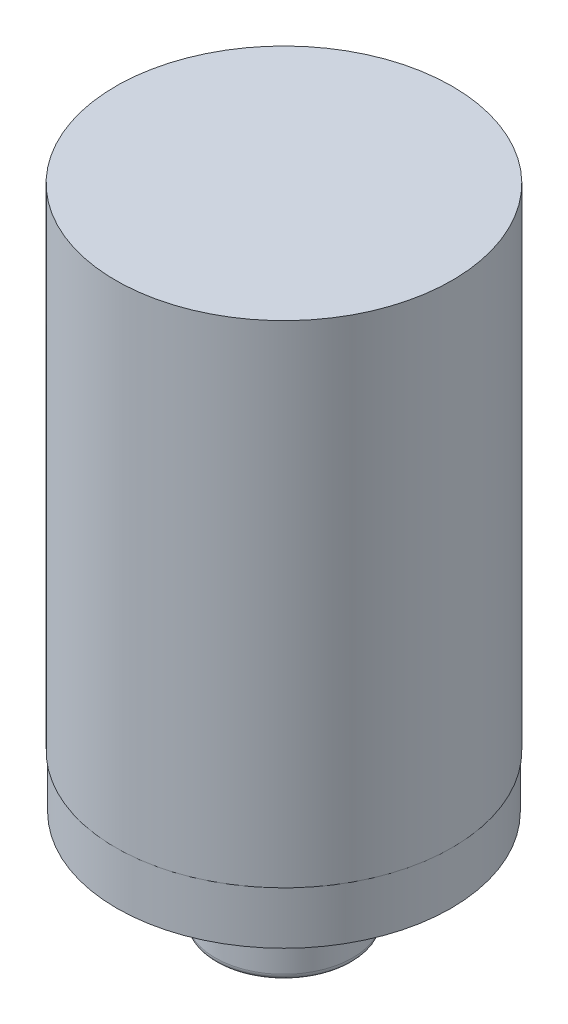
ISO-10303-21;
HEADER;
FILE_DESCRIPTION(('STEP AP214'),'2;1');
FILE_NAME('part.step','',(''),(''),'','','');
FILE_SCHEMA(('AUTOMOTIVE_DESIGN { 1 0 10303 214 1 1 1 1 }'));
ENDSEC;
DATA;
#1=APPLICATION_CONTEXT('core data for automotive mechanical design processes');
#2=APPLICATION_PROTOCOL_DEFINITION('international standard','automotive_design',2000,#1);
#3=PRODUCT_CONTEXT('',#1,'mechanical');
#4=PRODUCT('Part','Part','',(#3));
#5=PRODUCT_RELATED_PRODUCT_CATEGORY('part','',(#4));
#6=PRODUCT_DEFINITION_FORMATION('','',#4);
#7=PRODUCT_DEFINITION_CONTEXT('part definition',#1,'design');
#8=PRODUCT_DEFINITION('design','',#6,#7);
#9=PRODUCT_DEFINITION_SHAPE('','',#8);
#10=(LENGTH_UNIT() NAMED_UNIT(*) SI_UNIT(.MILLI.,.METRE.));
#11=(NAMED_UNIT(*) PLANE_ANGLE_UNIT() SI_UNIT($,.RADIAN.));
#12=(NAMED_UNIT(*) SI_UNIT($,.STERADIAN.) SOLID_ANGLE_UNIT());
#13=UNCERTAINTY_MEASURE_WITH_UNIT(LENGTH_MEASURE(1.E-05),#10,'distance_accuracy_value','');
#14=(GEOMETRIC_REPRESENTATION_CONTEXT(3) GLOBAL_UNCERTAINTY_ASSIGNED_CONTEXT((#13)) GLOBAL_UNIT_ASSIGNED_CONTEXT((#10,
#11,#12)) REPRESENTATION_CONTEXT('',''));
#15=CARTESIAN_POINT('',(0.,0.,0.));
#16=DIRECTION('',(0.,0.,1.));
#17=DIRECTION('',(1.,0.,0.));
#18=AXIS2_PLACEMENT_3D('',#15,#16,#17);
#19=CARTESIAN_POINT('',(0.,0.,0.));
#20=DIRECTION('',(0.,1.,0.));
#21=DIRECTION('',(0.,0.,1.));
#22=AXIS2_PLACEMENT_3D('',#19,#20,#21);
#23=PLANE('',#22);
#24=CARTESIAN_POINT('',(0.,0.,16.1887965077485));
#25=DIRECTION('',(0.,1.,0.));
#26=DIRECTION('',(0.,0.,1.));
#27=AXIS2_PLACEMENT_3D('',#24,#25,#26);
#28=CIRCLE('',#27,2.7051);
#29=CARTESIAN_POINT('',(0.,0.,18.8938965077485));
#30=VERTEX_POINT('',#29);
#31=EDGE_CURVE('E191',#30,#30,#28,.F.);
#32=ORIENTED_EDGE('',*,*,#31,.F.);
#33=EDGE_LOOP('',(#32));
#34=FACE_BOUND('',#33,.T.);
#35=CARTESIAN_POINT('',(-9.3345,0.,-13.2266489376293));
#36=DIRECTION('',(0.,1.,0.));
#37=DIRECTION('',(0.,0.,1.));
#38=AXIS2_PLACEMENT_3D('',#35,#36,#37);
#39=CIRCLE('',#38,2.7051);
#40=CARTESIAN_POINT('',(-9.3345,0.,-10.5215489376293));
#41=VERTEX_POINT('',#40);
#42=EDGE_CURVE('E183',#41,#41,#39,.F.);
#43=ORIENTED_EDGE('',*,*,#42,.F.);
#44=EDGE_LOOP('',(#43));
#45=FACE_BOUND('',#44,.T.);
#46=CARTESIAN_POINT('',(0.,0.,0.));
#47=DIRECTION('',(0.,1.,0.));
#48=DIRECTION('',(0.,0.,1.));
#49=AXIS2_PLACEMENT_3D('',#46,#47,#48);
#50=CIRCLE('',#49,21.6027);
#51=CARTESIAN_POINT('',(0.,0.,21.6027));
#52=VERTEX_POINT('',#51);
#53=EDGE_CURVE('E179',#52,#52,#50,.T.);
#54=ORIENTED_EDGE('',*,*,#53,.F.);
#55=EDGE_LOOP('',(#54));
#56=FACE_BOUND('',#55,.T.);
#57=CARTESIAN_POINT('',(9.3345,0.,-13.2266489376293));
#58=DIRECTION('',(0.,1.,0.));
#59=DIRECTION('',(0.,0.,1.));
#60=AXIS2_PLACEMENT_3D('',#57,#58,#59);
#61=CIRCLE('',#60,2.7051);
#62=CARTESIAN_POINT('',(9.3345,0.,-10.5215489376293));
#63=VERTEX_POINT('',#62);
#64=EDGE_CURVE('E188',#63,#63,#61,.F.);
#65=ORIENTED_EDGE('',*,*,#64,.F.);
#66=EDGE_LOOP('',(#65));
#67=FACE_BOUND('',#66,.T.);
#68=CARTESIAN_POINT('',(0.,0.,0.));
#69=DIRECTION('',(0.,1.,0.));
#70=DIRECTION('',(0.,0.,1.));
#71=AXIS2_PLACEMENT_3D('',#68,#69,#70);
#72=CIRCLE('',#71,8.89);
#73=CARTESIAN_POINT('',(0.,0.,8.89));
#74=VERTEX_POINT('',#73);
#75=EDGE_CURVE('E194',#74,#74,#72,.F.);
#76=ORIENTED_EDGE('',*,*,#75,.F.);
#77=EDGE_LOOP('',(#76));
#78=FACE_BOUND('',#77,.T.);
#79=ADVANCED_FACE('F131',(#34,#45,#56,#67,#78),#23,.F.);
#80=CARTESIAN_POINT('',(0.,6.858,0.));
#81=DIRECTION('',(0.,-1.,0.));
#82=DIRECTION('',(0.,0.,-1.));
#83=AXIS2_PLACEMENT_3D('',#80,#81,#82);
#84=CYLINDRICAL_SURFACE('',#83,21.6027);
#85=CARTESIAN_POINT('',(0.,6.858,0.));
#86=DIRECTION('',(0.,1.,0.));
#87=DIRECTION('',(0.,0.,1.));
#88=AXIS2_PLACEMENT_3D('',#85,#86,#87);
#89=CIRCLE('',#88,21.6027);
#90=CARTESIAN_POINT('',(0.,6.858,21.6027));
#91=VERTEX_POINT('',#90);
#92=EDGE_CURVE('E180',#91,#91,#89,.T.);
#93=ORIENTED_EDGE('',*,*,#92,.F.);
#94=EDGE_LOOP('',(#93));
#95=FACE_BOUND('',#94,.T.);
#96=ORIENTED_EDGE('',*,*,#53,.T.);
#97=EDGE_LOOP('',(#96));
#98=FACE_BOUND('',#97,.T.);
#99=ADVANCED_FACE('F220',(#95,#98),#84,.T.);
#100=CARTESIAN_POINT('',(0.,6.858,0.));
#101=DIRECTION('',(0.,1.,0.));
#102=DIRECTION('',(0.,0.,1.));
#103=AXIS2_PLACEMENT_3D('',#100,#101,#102);
#104=PLANE('',#103);
#105=CARTESIAN_POINT('',(0.,6.858,0.));
#106=DIRECTION('',(0.,1.,0.));
#107=DIRECTION('',(0.,0.,1.));
#108=AXIS2_PLACEMENT_3D('',#105,#106,#107);
#109=CIRCLE('',#108,21.7424);
#110=CARTESIAN_POINT('',(0.,6.858,-21.7424));
#111=VERTEX_POINT('',#110);
#112=EDGE_CURVE('E173',#111,#111,#109,.T.);
#113=ORIENTED_EDGE('',*,*,#112,.F.);
#114=EDGE_LOOP('',(#113));
#115=FACE_BOUND('',#114,.T.);
#116=ORIENTED_EDGE('',*,*,#92,.T.);
#117=EDGE_LOOP('',(#116));
#118=FACE_BOUND('',#117,.T.);
#119=ADVANCED_FACE('F297',(#115,#118),#104,.F.);
#120=CARTESIAN_POINT('',(0.,202.212793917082,0.));
#121=DIRECTION('',(0.,-1.,0.));
#122=DIRECTION('',(0.,0.,-1.));
#123=AXIS2_PLACEMENT_3D('',#120,#121,#122);
#124=CYLINDRICAL_SURFACE('',#123,21.7424);
#125=CARTESIAN_POINT('',(0.,70.358,0.));
#126=DIRECTION('',(0.,1.,0.));
#127=DIRECTION('',(0.,0.,1.));
#128=AXIS2_PLACEMENT_3D('',#125,#126,#127);
#129=CIRCLE('',#128,21.7424);
#130=CARTESIAN_POINT('',(0.,70.358,-21.7424));
#131=VERTEX_POINT('',#130);
#132=EDGE_CURVE('E176',#131,#131,#129,.T.);
#133=CARTESIAN_POINT('',(0.,6.858,-21.7424));
#134=CARTESIAN_POINT('',(0.,7.51945833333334,-21.7424));
#135=CARTESIAN_POINT('',(0.,8.18091666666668,-21.7424));
#136=CARTESIAN_POINT('',(0.,9.50383333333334,-21.7424));
#137=CARTESIAN_POINT('',(0.,10.1652916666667,-21.7424));
#138=CARTESIAN_POINT('',(0.,11.4882083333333,-21.7424));
#139=CARTESIAN_POINT('',(0.,12.1496666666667,-21.7424));
#140=CARTESIAN_POINT('',(0.,13.4725833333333,-21.7424));
#141=CARTESIAN_POINT('',(0.,14.1340416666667,-21.7424));
#142=CARTESIAN_POINT('',(0.,15.4569583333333,-21.7424));
#143=CARTESIAN_POINT('',(0.,16.1184166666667,-21.7424));
#144=CARTESIAN_POINT('',(0.,17.4413333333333,-21.7424));
#145=CARTESIAN_POINT('',(0.,18.1027916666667,-21.7424));
#146=CARTESIAN_POINT('',(0.,19.4257083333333,-21.7424));
#147=CARTESIAN_POINT('',(0.,20.0871666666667,-21.7424));
#148=CARTESIAN_POINT('',(0.,21.4100833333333,-21.7424));
#149=CARTESIAN_POINT('',(0.,22.0715416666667,-21.7424));
#150=CARTESIAN_POINT('',(0.,23.3944583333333,-21.7424));
#151=CARTESIAN_POINT('',(0.,24.0559166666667,-21.7424));
#152=CARTESIAN_POINT('',(0.,25.3788333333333,-21.7424));
#153=CARTESIAN_POINT('',(0.,26.0402916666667,-21.7424));
#154=CARTESIAN_POINT('',(0.,27.3632083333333,-21.7424));
#155=CARTESIAN_POINT('',(0.,28.0246666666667,-21.7424));
#156=CARTESIAN_POINT('',(0.,29.3475833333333,-21.7424));
#157=CARTESIAN_POINT('',(0.,30.0090416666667,-21.7424));
#158=CARTESIAN_POINT('',(0.,31.3319583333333,-21.7424));
#159=CARTESIAN_POINT('',(0.,31.9934166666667,-21.7424));
#160=CARTESIAN_POINT('',(0.,33.3163333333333,-21.7424));
#161=CARTESIAN_POINT('',(0.,33.9777916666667,-21.7424));
#162=CARTESIAN_POINT('',(0.,35.3007083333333,-21.7424));
#163=CARTESIAN_POINT('',(0.,35.9621666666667,-21.7424));
#164=CARTESIAN_POINT('',(0.,37.2850833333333,-21.7424));
#165=CARTESIAN_POINT('',(0.,37.9465416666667,-21.7424));
#166=CARTESIAN_POINT('',(0.,39.2694583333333,-21.7424));
#167=CARTESIAN_POINT('',(0.,39.9309166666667,-21.7424));
#168=CARTESIAN_POINT('',(0.,41.2538333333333,-21.7424));
#169=CARTESIAN_POINT('',(0.,41.9152916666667,-21.7424));
#170=CARTESIAN_POINT('',(0.,43.2382083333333,-21.7424));
#171=CARTESIAN_POINT('',(0.,43.8996666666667,-21.7424));
#172=CARTESIAN_POINT('',(0.,45.2225833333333,-21.7424));
#173=CARTESIAN_POINT('',(0.,45.8840416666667,-21.7424));
#174=CARTESIAN_POINT('',(0.,47.2069583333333,-21.7424));
#175=CARTESIAN_POINT('',(0.,47.8684166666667,-21.7424));
#176=CARTESIAN_POINT('',(0.,49.1913333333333,-21.7424));
#177=CARTESIAN_POINT('',(0.,49.8527916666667,-21.7424));
#178=CARTESIAN_POINT('',(0.,51.1757083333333,-21.7424));
#179=CARTESIAN_POINT('',(0.,51.8371666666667,-21.7424));
#180=CARTESIAN_POINT('',(0.,53.1600833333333,-21.7424));
#181=CARTESIAN_POINT('',(0.,53.8215416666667,-21.7424));
#182=CARTESIAN_POINT('',(0.,55.1444583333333,-21.7424));
#183=CARTESIAN_POINT('',(0.,55.8059166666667,-21.7424));
#184=CARTESIAN_POINT('',(0.,57.1288333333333,-21.7424));
#185=CARTESIAN_POINT('',(0.,57.7902916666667,-21.7424));
#186=CARTESIAN_POINT('',(0.,59.1132083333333,-21.7424));
#187=CARTESIAN_POINT('',(0.,59.7746666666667,-21.7424));
#188=CARTESIAN_POINT('',(0.,61.0975833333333,-21.7424));
#189=CARTESIAN_POINT('',(0.,61.7590416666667,-21.7424));
#190=CARTESIAN_POINT('',(0.,63.0819583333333,-21.7424));
#191=CARTESIAN_POINT('',(0.,63.7434166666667,-21.7424));
#192=CARTESIAN_POINT('',(0.,65.0663333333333,-21.7424));
#193=CARTESIAN_POINT('',(0.,65.7277916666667,-21.7424));
#194=CARTESIAN_POINT('',(0.,67.0507083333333,-21.7424));
#195=CARTESIAN_POINT('',(0.,67.7121666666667,-21.7424));
#196=CARTESIAN_POINT('',(0.,69.0350833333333,-21.7424));
#197=CARTESIAN_POINT('',(0.,69.6965416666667,-21.7424));
#198=CARTESIAN_POINT('',(0.,70.358,-21.7424));
#199=B_SPLINE_CURVE_WITH_KNOTS('',3,(#133,#134,#135,#136,#137,#138,#139,#140,#141,#142,#143,
#144,#145,#146,#147,#148,#149,#150,#151,#152,#153,#154,#155,#156,#157,#158,#159,#160,#161,#162,
#163,#164,#165,#166,#167,#168,#169,#170,#171,#172,#173,#174,#175,#176,#177,#178,#179,#180,#181,
#182,#183,#184,#185,#186,#187,#188,#189,#190,#191,#192,#193,#194,#195,#196,#197,#198),
.UNSPECIFIED.,.F.,.F.,(4,2,2,2,2,2,2,2,2,2,2,2,2,2,2,2,2,2,2,2,2,2,2,2,2,2,2,2,2,2,2,2,4),(0.,
1.98437500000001,3.96874999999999,5.953125,7.93749999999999,9.921875,11.90625,13.890625,15.875,
17.859375,19.84375,21.828125,23.8125,25.796875,27.78125,29.765625,31.75,33.734375,35.71875,
37.703125,39.6875,41.671875,43.65625,45.640625,47.625,49.609375,51.59375,53.578125,55.5625,
57.546875,59.53125,61.515625,63.5),.UNSPECIFIED.);
#200=EDGE_CURVE('BSEAM300',#111,#131,#199,.T.);
#201=ORIENTED_EDGE('',*,*,#112,.T.);
#202=ORIENTED_EDGE('',*,*,#132,.F.);
#203=ORIENTED_EDGE('',*,*,#200,.T.);
#204=ORIENTED_EDGE('',*,*,#200,.F.);
#205=EDGE_LOOP('',(#201,#203,#202,#204));
#206=FACE_BOUND('',#205,.T.);
#207=ADVANCED_FACE('F300',(#206),#124,.T.);
#208=CARTESIAN_POINT('',(0.,70.358,0.));
#209=DIRECTION('',(0.,1.,0.));
#210=DIRECTION('',(0.,0.,1.));
#211=AXIS2_PLACEMENT_3D('',#208,#209,#210);
#212=PLANE('',#211);
#213=ORIENTED_EDGE('',*,*,#132,.T.);
#214=EDGE_LOOP('',(#213));
#215=FACE_BOUND('',#214,.T.);
#216=ADVANCED_FACE('F304',(#215),#212,.T.);
#217=CARTESIAN_POINT('',(-9.3345,-0.508,-13.2266489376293));
#218=DIRECTION('',(0.,1.,0.));
#219=DIRECTION('',(0.,0.,1.));
#220=AXIS2_PLACEMENT_3D('',#217,#218,#219);
#221=CYLINDRICAL_SURFACE('',#220,2.7051);
#222=CARTESIAN_POINT('',(-9.33449999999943,-0.508148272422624,-10.5215489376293));
#223=CARTESIAN_POINT('',(-9.48644665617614,-0.508149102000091,-10.5215556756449));
#224=CARTESIAN_POINT('',(-9.63850348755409,-0.508167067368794,-10.5343942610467));
#225=CARTESIAN_POINT('',(-9.93842940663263,-0.508153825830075,-10.5854317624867));
#226=CARTESIAN_POINT('',(-10.0862932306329,-0.508122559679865,-10.6236612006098));
#227=CARTESIAN_POINT('',(-10.3734445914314,-0.508100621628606,-10.7243921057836));
#228=CARTESIAN_POINT('',(-10.5127361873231,-0.50810993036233,-10.7868819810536));
#229=CARTESIAN_POINT('',(-10.7788120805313,-0.508140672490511,-10.9343439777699));
#230=CARTESIAN_POINT('',(-10.9055994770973,-0.508162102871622,-11.019310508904));
#231=CARTESIAN_POINT('',(-11.1431258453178,-0.508187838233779,-11.2093310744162));
#232=CARTESIAN_POINT('',(-11.2538631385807,-0.508192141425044,-11.314387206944));
#233=CARTESIAN_POINT('',(-11.4561326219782,-0.508179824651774,-11.5416037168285));
#234=CARTESIAN_POINT('',(-11.5476640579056,-0.508163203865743,-11.6637647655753));
#235=CARTESIAN_POINT('',(-11.7089168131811,-0.508121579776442,-11.9217176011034));
#236=CARTESIAN_POINT('',(-11.7786385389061,-0.508096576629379,-12.0575091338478));
#237=CARTESIAN_POINT('',(-11.8942947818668,-0.508101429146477,-12.3388698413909));
#238=CARTESIAN_POINT('',(-11.9402293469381,-0.50813128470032,-12.4844389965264));
#239=CARTESIAN_POINT('',(-12.007007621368,-0.508159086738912,-12.7812231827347));
#240=CARTESIAN_POINT('',(-12.0278512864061,-0.508157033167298,-12.9324382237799));
#241=CARTESIAN_POINT('',(-12.043855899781,-0.508162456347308,-13.2362211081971));
#242=CARTESIAN_POINT('',(-12.0390168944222,-0.50816993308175,-13.3887889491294));
#243=CARTESIAN_POINT('',(-12.0037936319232,-0.508155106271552,-13.6909468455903));
#244=CARTESIAN_POINT('',(-11.9734093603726,-0.508132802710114,-13.840536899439));
#245=CARTESIAN_POINT('',(-11.887958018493,-0.508104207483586,-14.1324928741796));
#246=CARTESIAN_POINT('',(-11.8328909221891,-0.508097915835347,-14.274858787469));
#247=CARTESIAN_POINT('',(-11.699637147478,-0.508118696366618,-14.548324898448));
#248=CARTESIAN_POINT('',(-11.6214504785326,-0.508145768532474,-14.6794251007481));
#249=CARTESIAN_POINT('',(-11.4441770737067,-0.508181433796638,-14.9266382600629));
#250=CARTESIAN_POINT('',(-11.3450903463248,-0.50819002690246,-15.0427512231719));
#251=CARTESIAN_POINT('',(-11.1288295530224,-0.508187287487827,-15.2566938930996));
#252=CARTESIAN_POINT('',(-11.0116554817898,-0.50817595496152,-15.3545235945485));
#253=CARTESIAN_POINT('',(-10.7625462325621,-0.508140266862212,-15.5291226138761));
#254=CARTESIAN_POINT('',(-10.6306110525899,-0.508115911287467,-15.6058919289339));
#255=CARTESIAN_POINT('',(-10.3557248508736,-0.508105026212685,-15.7361909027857));
#256=CARTESIAN_POINT('',(-10.2127738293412,-0.508118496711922,-15.7897205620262));
#257=CARTESIAN_POINT('',(-9.91991390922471,-0.508143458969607,-15.8720206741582));
#258=CARTESIAN_POINT('',(-9.77000501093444,-0.508154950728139,-15.9007911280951));
#259=CARTESIAN_POINT('',(-9.46748482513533,-0.508159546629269,-15.932756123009));
#260=CARTESIAN_POINT('',(-9.31487353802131,-0.508152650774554,-15.9359506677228));
#261=CARTESIAN_POINT('',(-9.01128073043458,-0.508151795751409,-15.9166731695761));
#262=CARTESIAN_POINT('',(-8.8602992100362,-0.508157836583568,-15.8942011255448));
#263=CARTESIAN_POINT('',(-8.56425184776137,-0.508136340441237,-15.8242283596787));
#264=CARTESIAN_POINT('',(-8.4191860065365,-0.508108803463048,-15.7767276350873));
#265=CARTESIAN_POINT('',(-8.13908802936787,-0.508103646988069,-15.6580459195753));
#266=CARTESIAN_POINT('',(-8.00405589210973,-0.50812602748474,-15.5868649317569));
#267=CARTESIAN_POINT('',(-7.74785850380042,-0.508164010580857,-15.4228433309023));
#268=CARTESIAN_POINT('',(-7.6266932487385,-0.508179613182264,-15.3300027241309));
#269=CARTESIAN_POINT('',(-7.40166905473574,-0.508191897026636,-15.125297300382));
#270=CARTESIAN_POINT('',(-7.29781012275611,-0.508188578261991,-15.0134324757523));
#271=CARTESIAN_POINT('',(-7.11034684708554,-0.508161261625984,-14.773854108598));
#272=CARTESIAN_POINT('',(-7.02674251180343,-0.508137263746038,-14.6461405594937));
#273=CARTESIAN_POINT('',(-6.88216184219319,-0.508103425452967,-14.378490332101));
#274=CARTESIAN_POINT('',(-6.82118548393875,-0.508093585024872,-14.2385536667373));
#275=CARTESIAN_POINT('',(-6.72359160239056,-0.508117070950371,-13.9504295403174));
#276=CARTESIAN_POINT('',(-6.6869740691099,-0.508150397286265,-13.802242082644));
#277=CARTESIAN_POINT('',(-6.63913721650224,-0.508171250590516,-13.5018226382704));
#278=CARTESIAN_POINT('',(-6.6279179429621,-0.508158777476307,-13.3495906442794));
#279=CARTESIAN_POINT('',(-6.63119621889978,-0.508157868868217,-13.0454040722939));
#280=CARTESIAN_POINT('',(-6.64569372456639,-0.508169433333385,-12.8934494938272));
#281=CARTESIAN_POINT('',(-6.69999401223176,-0.50814578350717,-12.5941307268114));
#282=CARTESIAN_POINT('',(-6.73979684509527,-0.508110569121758,-12.4467665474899));
#283=CARTESIAN_POINT('',(-6.84357881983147,-0.50809190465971,-12.1608094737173));
#284=CARTESIAN_POINT('',(-6.90755841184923,-0.508108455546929,-12.0222167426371));
#285=CARTESIAN_POINT('',(-7.05787500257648,-0.508146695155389,-11.7577451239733));
#286=CARTESIAN_POINT('',(-7.14421112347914,-0.508168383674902,-11.6318657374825));
#287=CARTESIAN_POINT('',(-7.33677965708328,-0.508190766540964,-11.3964003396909));
#288=CARTESIAN_POINT('',(-7.44300998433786,-0.508191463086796,-11.2868126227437));
#289=CARTESIAN_POINT('',(-7.67239193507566,-0.508174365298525,-11.0869994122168));
#290=CARTESIAN_POINT('',(-7.79554775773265,-0.508156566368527,-10.9967787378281));
#291=CARTESIAN_POINT('',(-8.05530616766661,-0.508119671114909,-10.8382600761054));
#292=CARTESIAN_POINT('',(-8.19191514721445,-0.508100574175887,-10.7699725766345));
#293=CARTESIAN_POINT('',(-8.47455151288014,-0.508112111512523,-10.6573801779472));
#294=CARTESIAN_POINT('',(-8.62056737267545,-0.508142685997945,-10.6130465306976));
#295=CARTESIAN_POINT('',(-8.86201149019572,-0.508161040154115,-10.5614361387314));
#296=CARTESIAN_POINT('',(-8.95587090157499,-0.508160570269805,-10.5464971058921));
#297=CARTESIAN_POINT('',(-9.14463920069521,-0.508153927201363,-10.5265514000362));
#298=CARTESIAN_POINT('',(-9.23954808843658,-0.508147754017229,-10.5215447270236));
#299=CARTESIAN_POINT('',(-9.33449999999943,-0.508148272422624,-10.5215489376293));
#300=B_SPLINE_CURVE_WITH_KNOTS('',3,(#222,#223,#224,#225,#226,#227,#228,#229,#230,#231,#232,
#233,#234,#235,#236,#237,#238,#239,#240,#241,#242,#243,#244,#245,#246,#247,#248,#249,#250,#251,
#252,#253,#254,#255,#256,#257,#258,#259,#260,#261,#262,#263,#264,#265,#266,#267,#268,#269,#270,
#271,#272,#273,#274,#275,#276,#277,#278,#279,#280,#281,#282,#283,#284,#285,#286,#287,#288,#289,
#290,#291,#292,#293,#294,#295,#296,#297,#298,#299),.UNSPECIFIED.,.T.,.F.,(4,2,2,2,2,2,2,2,2,2,2,
2,2,2,2,2,2,2,2,2,2,2,2,2,2,2,2,2,2,2,2,2,2,2,2,2,2,2,4),(0.,0.455493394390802,
0.911535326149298,1.3673596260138,1.82307066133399,2.27882931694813,2.73460586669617,
3.19037392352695,3.64614106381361,4.10190900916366,4.55767613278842,5.01344351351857,
5.46921137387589,5.92497904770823,6.38074653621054,6.83651415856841,7.29228184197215,
7.74804951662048,8.20381717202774,8.65958476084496,9.1153523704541,9.57112003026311,
10.0268876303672,10.4826550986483,10.9384227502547,11.3941905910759,11.8499579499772,
12.3057251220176,12.7614931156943,13.2172603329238,13.673028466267,14.1288050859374,
14.5845638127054,15.0402747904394,15.4960990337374,15.9521409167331,16.4076342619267,
16.692273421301,16.9769125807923),.UNSPECIFIED.);
#301=CARTESIAN_POINT('',(-9.33449999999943,-0.508148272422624,-10.5215489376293));
#302=VERTEX_POINT('',#301);
#303=EDGE_CURVE('E167',#302,#302,#300,.T.);
#304=ORIENTED_EDGE('',*,*,#303,.F.);
#305=EDGE_LOOP('',(#304));
#306=FACE_BOUND('',#305,.T.);
#307=ORIENTED_EDGE('',*,*,#42,.T.);
#308=EDGE_LOOP('',(#307));
#309=FACE_BOUND('',#308,.T.);
#310=ADVANCED_FACE('F208',(#306,#309),#221,.T.);
#311=CARTESIAN_POINT('',(-6.52025979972,-0.183329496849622,-16.0295273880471));
#312=CARTESIAN_POINT('',(-6.52025979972,-0.257859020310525,-15.581067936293));
#313=CARTESIAN_POINT('',(-6.52025979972,-0.325506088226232,-15.1326084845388));
#314=CARTESIAN_POINT('',(-6.52025979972,-0.388387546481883,-14.6841490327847));
#315=CARTESIAN_POINT('',(-6.52025979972,-0.460017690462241,-14.0114589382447));
#316=CARTESIAN_POINT('',(-6.52025979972,-0.479718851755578,-13.3387688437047));
#317=CARTESIAN_POINT('',(-6.52025979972,-0.479718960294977,-13.1145382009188));
#318=CARTESIAN_POINT('',(-6.52025979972,-0.460018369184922,-12.4418462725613));
#319=CARTESIAN_POINT('',(-6.52025979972,-0.38838832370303,-11.7691543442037));
#320=CARTESIAN_POINT('',(-6.52025979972,-0.325506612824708,-11.3206930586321));
#321=CARTESIAN_POINT('',(-6.52025979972,-0.25785932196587,-10.8722317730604));
#322=CARTESIAN_POINT('',(-6.52025979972,-0.183329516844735,-10.4237704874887));
#323=CARTESIAN_POINT('',(-6.9705371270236,-0.258652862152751,-16.0295273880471));
#324=CARTESIAN_POINT('',(-6.9705371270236,-0.345434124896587,-15.581067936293));
#325=CARTESIAN_POINT('',(-6.9705371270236,-0.425227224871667,-15.1326084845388));
#326=CARTESIAN_POINT('',(-6.9705371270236,-0.500819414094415,-14.6841490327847));
#327=CARTESIAN_POINT('',(-6.9705371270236,-0.587700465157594,-14.0114589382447));
#328=CARTESIAN_POINT('',(-6.9705371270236,-0.611684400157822,-13.3387688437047));
#329=CARTESIAN_POINT('',(-6.9705371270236,-0.611684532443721,-13.1145382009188));
#330=CARTESIAN_POINT('',(-6.9705371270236,-0.587701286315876,-12.4418462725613));
#331=CARTESIAN_POINT('',(-6.9705371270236,-0.500820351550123,-11.7691543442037));
#332=CARTESIAN_POINT('',(-6.9705371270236,-0.425227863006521,-11.3206930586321));
#333=CARTESIAN_POINT('',(-6.9705371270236,-0.34543449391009,-10.8722317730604));
#334=CARTESIAN_POINT('',(-6.9705371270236,-0.258652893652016,-10.4237704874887));
#335=CARTESIAN_POINT('',(-7.42081445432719,-0.327033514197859,-16.0295273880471));
#336=CARTESIAN_POINT('',(-7.42081445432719,-0.425954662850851,-15.581067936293));
#337=CARTESIAN_POINT('',(-7.42081445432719,-0.517693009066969,-15.1326084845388));
#338=CARTESIAN_POINT('',(-7.42081445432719,-0.606370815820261,-14.6841490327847));
#339=CARTESIAN_POINT('',(-7.42081445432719,-0.709004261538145,-14.0114589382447));
#340=CARTESIAN_POINT('',(-7.42081445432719,-0.737437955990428,-13.3387688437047));
#341=CARTESIAN_POINT('',(-7.42081445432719,-0.737438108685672,-13.1145382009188));
#342=CARTESIAN_POINT('',(-7.42081445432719,-0.709005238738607,-12.4418462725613));
#343=CARTESIAN_POINT('',(-7.42081445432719,-0.606371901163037,-11.7691543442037));
#344=CARTESIAN_POINT('',(-7.42081445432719,-0.517693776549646,-11.3206930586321));
#345=CARTESIAN_POINT('',(-7.42081445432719,-0.425955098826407,-10.8722317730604));
#346=CARTESIAN_POINT('',(-7.42081445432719,-0.327033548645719,-10.4237704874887));
#347=CARTESIAN_POINT('',(-7.87109178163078,-0.390683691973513,-16.0295273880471));
#348=CARTESIAN_POINT('',(-7.87109178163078,-0.502282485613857,-15.581067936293));
#349=CARTESIAN_POINT('',(-7.87109178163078,-0.60706379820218,-15.1326084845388));
#350=CARTESIAN_POINT('',(-7.87109178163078,-0.709890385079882,-14.6841490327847));
#351=CARTESIAN_POINT('',(-7.87109178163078,-0.82721559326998,-14.0114589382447));
#352=CARTESIAN_POINT('',(-7.87109178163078,-0.860138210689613,-13.3387688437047));
#353=CARTESIAN_POINT('',(-7.87109178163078,-0.860138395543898,-13.1145382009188));
#354=CARTESIAN_POINT('',(-7.87109178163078,-0.82721669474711,-12.4418462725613));
#355=CARTESIAN_POINT('',(-7.87109178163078,-0.709891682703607,-11.7691543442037));
#356=CARTESIAN_POINT('',(-7.87109178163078,-0.607064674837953,-11.3206930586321));
#357=CARTESIAN_POINT('',(-7.87109178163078,-0.502282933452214,-10.8722317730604));
#358=CARTESIAN_POINT('',(-7.87109178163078,-0.390683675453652,-10.4237704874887));
#359=CARTESIAN_POINT('',(-8.54650869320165,-0.463186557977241,-16.0295273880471));
#360=CARTESIAN_POINT('',(-8.54650869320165,-0.590028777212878,-15.581067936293));
#361=CARTESIAN_POINT('',(-8.54650869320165,-0.710537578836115,-15.1326084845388));
#362=CARTESIAN_POINT('',(-8.54650869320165,-0.828007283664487,-14.6841490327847));
#363=CARTESIAN_POINT('',(-8.54650869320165,-0.973139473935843,-14.0114589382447));
#364=CARTESIAN_POINT('',(-8.54650869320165,-1.01455331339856,-13.3387688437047));
#365=CARTESIAN_POINT('',(-8.54650869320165,-1.01455353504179,-13.1145382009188));
#366=CARTESIAN_POINT('',(-8.54650869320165,-0.973140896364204,-12.4418462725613));
#367=CARTESIAN_POINT('',(-8.54650869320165,-0.828008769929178,-11.7691543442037));
#368=CARTESIAN_POINT('',(-8.54650869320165,-0.710538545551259,-11.3206930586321));
#369=CARTESIAN_POINT('',(-8.54650869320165,-0.590029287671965,-10.8722317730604));
#370=CARTESIAN_POINT('',(-8.54650869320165,-0.463186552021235,-10.4237704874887));
#371=CARTESIAN_POINT('',(-9.22192560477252,-0.483092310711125,-16.0295273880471));
#372=CARTESIAN_POINT('',(-9.22192560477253,-0.614232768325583,-15.581067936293));
#373=CARTESIAN_POINT('',(-9.22192560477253,-0.739205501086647,-15.1326084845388));
#374=CARTESIAN_POINT('',(-9.22192560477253,-0.861148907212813,-14.6841490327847));
#375=CARTESIAN_POINT('',(-9.22192560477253,-1.0147670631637,-14.0114589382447));
#376=CARTESIAN_POINT('',(-9.22192560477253,-1.06244330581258,-13.3387688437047));
#377=CARTESIAN_POINT('',(-9.22192560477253,-1.06244358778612,-13.1145382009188));
#378=CARTESIAN_POINT('',(-9.22192560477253,-1.01476859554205,-12.4418462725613));
#379=CARTESIAN_POINT('',(-9.22192560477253,-0.86115043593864,-11.7691543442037));
#380=CARTESIAN_POINT('',(-9.22192560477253,-0.739206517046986,-11.3206930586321));
#381=CARTESIAN_POINT('',(-9.22192560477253,-0.614233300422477,-10.8722317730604));
#382=CARTESIAN_POINT('',(-9.22192560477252,-0.483092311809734,-10.4237704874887));
#383=CARTESIAN_POINT('',(-9.4470651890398,-0.483092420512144,-16.0295273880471));
#384=CARTESIAN_POINT('',(-9.4470651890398,-0.614232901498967,-15.581067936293));
#385=CARTESIAN_POINT('',(-9.4470651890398,-0.739205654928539,-15.1326084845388));
#386=CARTESIAN_POINT('',(-9.4470651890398,-0.861149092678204,-14.6841490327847));
#387=CARTESIAN_POINT('',(-9.4470651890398,-1.01476728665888,-14.0114589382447));
#388=CARTESIAN_POINT('',(-9.4470651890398,-1.06244358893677,-13.3387688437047));
#389=CARTESIAN_POINT('',(-9.4470651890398,-1.06244387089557,-13.1145382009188));
#390=CARTESIAN_POINT('',(-9.4470651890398,-1.01476881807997,-12.4418462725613));
#391=CARTESIAN_POINT('',(-9.4470651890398,-0.861150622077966,-11.7691543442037));
#392=CARTESIAN_POINT('',(-9.4470651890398,-0.739206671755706,-11.3206930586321));
#393=CARTESIAN_POINT('',(-9.4470651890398,-0.614233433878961,-10.8722317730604));
#394=CARTESIAN_POINT('',(-9.4470651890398,-0.48309242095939,-10.4237704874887));
#395=CARTESIAN_POINT('',(-10.1224839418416,-0.463187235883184,-16.0295273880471));
#396=CARTESIAN_POINT('',(-10.1224839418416,-0.590029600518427,-15.581067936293));
#397=CARTESIAN_POINT('',(-10.1224839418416,-0.710538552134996,-15.1326084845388));
#398=CARTESIAN_POINT('',(-10.1224839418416,-0.828008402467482,-14.6841490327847));
#399=CARTESIAN_POINT('',(-10.1224839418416,-0.973140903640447,-14.0114589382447));
#400=CARTESIAN_POINT('',(-10.1224839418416,-1.01455485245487,-13.3387688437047));
#401=CARTESIAN_POINT('',(-10.1224839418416,-1.01455507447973,-13.1145382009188));
#402=CARTESIAN_POINT('',(-10.1224839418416,-0.973142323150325,-12.4418462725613));
#403=CARTESIAN_POINT('',(-10.1224839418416,-0.82800987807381,-11.7691543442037));
#404=CARTESIAN_POINT('',(-10.1224839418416,-0.710539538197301,-11.3206930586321));
#405=CARTESIAN_POINT('',(-10.1224839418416,-0.590030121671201,-10.8722317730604));
#406=CARTESIAN_POINT('',(-10.1224839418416,-0.463187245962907,-10.4237704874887));
#407=CARTESIAN_POINT('',(-10.7979026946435,-0.390684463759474,-16.0295273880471));
#408=CARTESIAN_POINT('',(-10.7979026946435,-0.502283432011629,-15.581067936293));
#409=CARTESIAN_POINT('',(-10.7979026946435,-0.607064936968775,-15.1326084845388));
#410=CARTESIAN_POINT('',(-10.7979026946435,-0.709891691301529,-14.6841490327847));
#411=CARTESIAN_POINT('',(-10.7979026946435,-0.827217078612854,-14.0114589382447));
#412=CARTESIAN_POINT('',(-10.7979026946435,-0.860139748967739,-13.3387688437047));
#413=CARTESIAN_POINT('',(-10.7979026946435,-0.860139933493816,-13.1145382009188));
#414=CARTESIAN_POINT('',(-10.7979026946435,-0.827218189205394,-12.4418462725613));
#415=CARTESIAN_POINT('',(-10.7979026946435,-0.709892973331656,-11.7691543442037));
#416=CARTESIAN_POINT('',(-10.7979026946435,-0.607065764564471,-11.3206930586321));
#417=CARTESIAN_POINT('',(-10.7979026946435,-0.502283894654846,-10.8722317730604));
#418=CARTESIAN_POINT('',(-10.7979026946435,-0.390684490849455,-10.4237704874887));
#419=CARTESIAN_POINT('',(-11.248181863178,-0.327034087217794,-16.0295273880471));
#420=CARTESIAN_POINT('',(-11.248181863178,-0.425955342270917,-15.581067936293));
#421=CARTESIAN_POINT('',(-11.248181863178,-0.517693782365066,-15.1326084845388));
#422=CARTESIAN_POINT('',(-11.248181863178,-0.606371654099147,-14.6841490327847));
#423=CARTESIAN_POINT('',(-11.248181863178,-0.709005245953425,-14.0114589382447));
#424=CARTESIAN_POINT('',(-11.248181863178,-0.737438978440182,-13.3387688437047));
#425=CARTESIAN_POINT('',(-11.248181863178,-0.737439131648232,-13.1145382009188));
#426=CARTESIAN_POINT('',(-11.248181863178,-0.709006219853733,-12.4418462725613));
#427=CARTESIAN_POINT('',(-11.248181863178,-0.606372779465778,-11.7691543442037));
#428=CARTESIAN_POINT('',(-11.248181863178,-0.517694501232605,-11.3206930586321));
#429=CARTESIAN_POINT('',(-11.248181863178,-0.425955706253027,-10.8722317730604));
#430=CARTESIAN_POINT('',(-11.248181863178,-0.327034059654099,-10.4237704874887));
#431=CARTESIAN_POINT('',(-11.6984610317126,-0.258653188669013,-16.0295273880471));
#432=CARTESIAN_POINT('',(-11.6984610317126,-0.345434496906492,-15.581067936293));
#433=CARTESIAN_POINT('',(-11.6984610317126,-0.425227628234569,-15.1326084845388));
#434=CARTESIAN_POINT('',(-11.6984610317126,-0.500819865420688,-14.6841490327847));
#435=CARTESIAN_POINT('',(-11.6984610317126,-0.587700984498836,-14.0114589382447));
#436=CARTESIAN_POINT('',(-11.6984610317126,-0.611684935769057,-13.3387688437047));
#437=CARTESIAN_POINT('',(-11.6984610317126,-0.611685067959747,-13.1145382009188));
#438=CARTESIAN_POINT('',(-11.6984610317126,-0.587701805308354,-12.4418462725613));
#439=CARTESIAN_POINT('',(-11.6984610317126,-0.500820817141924,-11.7691543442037));
#440=CARTESIAN_POINT('',(-11.6984610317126,-0.42522826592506,-11.3206930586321));
#441=CARTESIAN_POINT('',(-11.6984610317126,-0.345434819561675,-10.8722317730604));
#442=CARTESIAN_POINT('',(-11.6984610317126,-0.258653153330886,-10.4237704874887));
#443=CARTESIAN_POINT('',(-12.1487402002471,-0.183329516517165,-16.0295273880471));
#444=CARTESIAN_POINT('',(-12.1487402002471,-0.257859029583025,-15.581067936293));
#445=CARTESIAN_POINT('',(-12.1487402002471,-0.325506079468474,-15.1326084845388));
#446=CARTESIAN_POINT('',(-12.1487402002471,-0.388387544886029,-14.6841490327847));
#447=CARTESIAN_POINT('',(-12.1487402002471,-0.460017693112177,-14.0114589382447));
#448=CARTESIAN_POINT('',(-12.1487402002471,-0.479718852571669,-13.3387688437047));
#449=CARTESIAN_POINT('',(-12.1487402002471,-0.479718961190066,-13.1145382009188));
#450=CARTESIAN_POINT('',(-12.1487402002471,-0.460018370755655,-12.4418462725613));
#451=CARTESIAN_POINT('',(-12.1487402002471,-0.388388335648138,-11.7691543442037));
#452=CARTESIAN_POINT('',(-12.1487402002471,-0.325506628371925,-11.3206930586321));
#453=CARTESIAN_POINT('',(-12.1487402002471,-0.257859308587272,-10.8722317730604));
#454=CARTESIAN_POINT('',(-12.1487402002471,-0.18332948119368,-10.4237704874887));
#455=B_SPLINE_SURFACE_WITH_KNOTS('',5,5,((#311,#312,#313,#314,#315,#316,#317,#318,#319,#320,
#321,#322),(#323,#324,#325,#326,#327,#328,#329,#330,#331,#332,#333,#334),(#335,#336,#337,#338,
#339,#340,#341,#342,#343,#344,#345,#346),(#347,#348,#349,#350,#351,#352,#353,#354,#355,#356,
#357,#358),(#359,#360,#361,#362,#363,#364,#365,#366,#367,#368,#369,#370),(#371,#372,#373,#374,
#375,#376,#377,#378,#379,#380,#381,#382),(#383,#384,#385,#386,#387,#388,#389,#390,#391,#392,
#393,#394),(#395,#396,#397,#398,#399,#400,#401,#402,#403,#404,#405,#406),(#407,#408,#409,#410,
#411,#412,#413,#414,#415,#416,#417,#418),(#419,#420,#421,#422,#423,#424,#425,#426,#427,#428,
#429,#430),(#431,#432,#433,#434,#435,#436,#437,#438,#439,#440,#441,#442),(#443,#444,#445,#446,
#447,#448,#449,#450,#451,#452,#453,#454)),.UNSPECIFIED.,.F.,.F.,.F.,(6,3,3,6),(6,3,3,6),
(-2.81424020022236,-0.562853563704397,0.562844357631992,2.81424020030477),(-2.80287845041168,
-0.560581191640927,0.560572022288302,2.80287845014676),.UNSPECIFIED.);
#456=ORIENTED_EDGE('',*,*,#303,.T.);
#457=EDGE_LOOP('',(#456));
#458=FACE_BOUND('',#457,.T.);
#459=ADVANCED_FACE('F212',(#458),#455,.F.);
#460=CARTESIAN_POINT('',(9.3345,-0.508,-13.2266489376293));
#461=DIRECTION('',(0.,1.,0.));
#462=DIRECTION('',(0.,0.,1.));
#463=AXIS2_PLACEMENT_3D('',#460,#461,#462);
#464=CYLINDRICAL_SURFACE('',#463,2.7051);
#465=CARTESIAN_POINT('',(9.33450000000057,-0.508148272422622,-10.5215489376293));
#466=CARTESIAN_POINT('',(9.18255334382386,-0.508149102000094,-10.5215556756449));
#467=CARTESIAN_POINT('',(9.0304965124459,-0.508167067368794,-10.5343942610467));
#468=CARTESIAN_POINT('',(8.73057059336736,-0.508153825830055,-10.5854317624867));
#469=CARTESIAN_POINT('',(8.58270676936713,-0.508122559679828,-10.6236612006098));
#470=CARTESIAN_POINT('',(8.29555540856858,-0.508100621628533,-10.7243921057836));
#471=CARTESIAN_POINT('',(8.15626381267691,-0.508109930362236,-10.7868819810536));
#472=CARTESIAN_POINT('',(7.89018791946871,-0.508140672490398,-10.9343439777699));
#473=CARTESIAN_POINT('',(7.76340052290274,-0.508162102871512,-11.0193105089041));
#474=CARTESIAN_POINT('',(7.52587415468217,-0.5081878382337,-11.2093310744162));
#475=CARTESIAN_POINT('',(7.41513686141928,-0.508192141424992,-11.314387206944));
#476=CARTESIAN_POINT('',(7.21286737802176,-0.508179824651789,-11.5416037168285));
#477=CARTESIAN_POINT('',(7.12133594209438,-0.508163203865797,-11.6637647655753));
#478=CARTESIAN_POINT('',(6.96008318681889,-0.508121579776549,-11.9217176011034));
#479=CARTESIAN_POINT('',(6.89036146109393,-0.508096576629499,-12.0575091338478));
#480=CARTESIAN_POINT('',(6.77470521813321,-0.508101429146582,-12.3388698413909));
#481=CARTESIAN_POINT('',(6.72877065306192,-0.508131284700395,-12.4844389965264));
#482=CARTESIAN_POINT('',(6.66199237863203,-0.50815908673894,-12.7812231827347));
#483=CARTESIAN_POINT('',(6.64114871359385,-0.508157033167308,-12.9324382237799));
#484=CARTESIAN_POINT('',(6.62514410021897,-0.508162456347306,-13.2362211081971));
#485=CARTESIAN_POINT('',(6.62998310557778,-0.508169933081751,-13.3887889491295));
#486=CARTESIAN_POINT('',(6.66520636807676,-0.5081551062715,-13.6909468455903));
#487=CARTESIAN_POINT('',(6.69559063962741,-0.508132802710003,-13.840536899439));
#488=CARTESIAN_POINT('',(6.78104198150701,-0.508104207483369,-14.1324928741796));
#489=CARTESIAN_POINT('',(6.8361090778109,-0.508097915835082,-14.274858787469));
#490=CARTESIAN_POINT('',(6.96936285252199,-0.508118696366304,-14.548324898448));
#491=CARTESIAN_POINT('',(7.04754952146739,-0.508145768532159,-14.6794251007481));
#492=CARTESIAN_POINT('',(7.22482292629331,-0.508181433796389,-14.9266382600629));
#493=CARTESIAN_POINT('',(7.32390965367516,-0.508190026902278,-15.042751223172));
#494=CARTESIAN_POINT('',(7.54017044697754,-0.508187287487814,-15.2566938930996));
#495=CARTESIAN_POINT('',(7.65734451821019,-0.50817595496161,-15.3545235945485));
#496=CARTESIAN_POINT('',(7.90645376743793,-0.508140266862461,-15.5291226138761));
#497=CARTESIAN_POINT('',(8.03838894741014,-0.508115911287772,-15.6058919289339));
#498=CARTESIAN_POINT('',(8.3132751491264,-0.508105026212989,-15.7361909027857));
#499=CARTESIAN_POINT('',(8.45622617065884,-0.508118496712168,-15.7897205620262));
#500=CARTESIAN_POINT('',(8.74908609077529,-0.508143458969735,-15.8720206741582));
#501=CARTESIAN_POINT('',(8.89899498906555,-0.508154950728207,-15.9007911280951));
#502=CARTESIAN_POINT('',(9.20151517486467,-0.508159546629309,-15.932756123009));
#503=CARTESIAN_POINT('',(9.35412646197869,-0.508152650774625,-15.9359506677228));
#504=CARTESIAN_POINT('',(9.65771926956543,-0.508151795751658,-15.9166731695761));
#505=CARTESIAN_POINT('',(9.80870078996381,-0.508157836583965,-15.8942011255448));
#506=CARTESIAN_POINT('',(10.1047481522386,-0.508136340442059,-15.8242283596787));
#507=CARTESIAN_POINT('',(10.2498139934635,-0.508108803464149,-15.7767276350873));
#508=CARTESIAN_POINT('',(10.5299119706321,-0.508103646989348,-15.6580459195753));
#509=CARTESIAN_POINT('',(10.6649441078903,-0.508126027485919,-15.5868649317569));
#510=CARTESIAN_POINT('',(10.9211414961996,-0.508164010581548,-15.4228433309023));
#511=CARTESIAN_POINT('',(11.0423067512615,-0.508179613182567,-15.3300027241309));
#512=CARTESIAN_POINT('',(11.2673309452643,-0.508191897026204,-15.125297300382));
#513=CARTESIAN_POINT('',(11.3711898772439,-0.508188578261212,-15.0134324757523));
#514=CARTESIAN_POINT('',(11.5586531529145,-0.508161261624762,-14.773854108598));
#515=CARTESIAN_POINT('',(11.6422574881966,-0.508137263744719,-14.6461405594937));
#516=CARTESIAN_POINT('',(11.7868381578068,-0.508103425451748,-14.378490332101));
#517=CARTESIAN_POINT('',(11.8478145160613,-0.508093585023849,-14.2385536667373));
#518=CARTESIAN_POINT('',(11.9454083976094,-0.508117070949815,-13.9504295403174));
#519=CARTESIAN_POINT('',(11.9820259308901,-0.50815039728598,-13.802242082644));
#520=CARTESIAN_POINT('',(12.0298627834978,-0.508171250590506,-13.5018226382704));
#521=CARTESIAN_POINT('',(12.0410820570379,-0.508158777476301,-13.3495906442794));
#522=CARTESIAN_POINT('',(12.0378037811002,-0.508157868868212,-13.0454040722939));
#523=CARTESIAN_POINT('',(12.0233062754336,-0.508169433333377,-12.8934494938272));
#524=CARTESIAN_POINT('',(11.9690059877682,-0.508145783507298,-12.5941307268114));
#525=CARTESIAN_POINT('',(11.9292031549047,-0.508110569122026,-12.4467665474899));
#526=CARTESIAN_POINT('',(11.8254211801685,-0.50809190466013,-12.1608094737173));
#527=CARTESIAN_POINT('',(11.7614415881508,-0.508108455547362,-12.0222167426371));
#528=CARTESIAN_POINT('',(11.6111249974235,-0.508146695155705,-11.7577451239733));
#529=CARTESIAN_POINT('',(11.5247888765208,-0.50816838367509,-11.6318657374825));
#530=CARTESIAN_POINT('',(11.3322203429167,-0.508190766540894,-11.3964003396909));
#531=CARTESIAN_POINT('',(11.2259900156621,-0.508191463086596,-11.2868126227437));
#532=CARTESIAN_POINT('',(10.9966080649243,-0.508174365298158,-11.0869994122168));
#533=CARTESIAN_POINT('',(10.8734522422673,-0.508156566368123,-10.9967787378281));
#534=CARTESIAN_POINT('',(10.6136938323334,-0.508119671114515,-10.8382600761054));
#535=CARTESIAN_POINT('',(10.4770848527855,-0.50810057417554,-10.7699725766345));
#536=CARTESIAN_POINT('',(10.1944484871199,-0.508112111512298,-10.6573801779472));
#537=CARTESIAN_POINT('',(10.0484326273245,-0.508142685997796,-10.6130465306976));
#538=CARTESIAN_POINT('',(9.80698850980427,-0.508161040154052,-10.5614361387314));
#539=CARTESIAN_POINT('',(9.713129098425,-0.508160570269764,-10.5464971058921));
#540=CARTESIAN_POINT('',(9.52436079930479,-0.508153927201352,-10.5265514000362));
#541=CARTESIAN_POINT('',(9.42945191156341,-0.508147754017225,-10.5215447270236));
#542=CARTESIAN_POINT('',(9.33450000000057,-0.508148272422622,-10.5215489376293));
#543=B_SPLINE_CURVE_WITH_KNOTS('',3,(#465,#466,#467,#468,#469,#470,#471,#472,#473,#474,#475,
#476,#477,#478,#479,#480,#481,#482,#483,#484,#485,#486,#487,#488,#489,#490,#491,#492,#493,#494,
#495,#496,#497,#498,#499,#500,#501,#502,#503,#504,#505,#506,#507,#508,#509,#510,#511,#512,#513,
#514,#515,#516,#517,#518,#519,#520,#521,#522,#523,#524,#525,#526,#527,#528,#529,#530,#531,#532,
#533,#534,#535,#536,#537,#538,#539,#540,#541,#542),.UNSPECIFIED.,.T.,.F.,(4,2,2,2,2,2,2,2,2,2,2,
2,2,2,2,2,2,2,2,2,2,2,2,2,2,2,2,2,2,2,2,2,2,2,2,2,2,2,4),(0.,0.455493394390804,
0.911535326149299,1.3673596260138,1.82307066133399,2.27882931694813,2.73460586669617,
3.19037392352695,3.64614106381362,4.10190900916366,4.55767613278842,5.01344351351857,
5.46921137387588,5.92497904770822,6.38074653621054,6.8365141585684,7.29228184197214,
7.74804951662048,8.20381717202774,8.65958476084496,9.11535237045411,9.57112003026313,
10.0268876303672,10.4826550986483,10.9384227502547,11.3941905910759,11.8499579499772,
12.3057251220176,12.7614931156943,13.2172603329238,13.673028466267,14.1288050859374,
14.5845638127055,15.0402747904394,15.4960990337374,15.9521409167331,16.4076342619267,
16.692273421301,16.9769125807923),.UNSPECIFIED.);
#544=CARTESIAN_POINT('',(9.33450000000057,-0.508148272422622,-10.5215489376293));
#545=VERTEX_POINT('',#544);
#546=EDGE_CURVE('E202',#545,#545,#543,.T.);
#547=ORIENTED_EDGE('',*,*,#546,.F.);
#548=EDGE_LOOP('',(#547));
#549=FACE_BOUND('',#548,.T.);
#550=ORIENTED_EDGE('',*,*,#64,.T.);
#551=EDGE_LOOP('',(#550));
#552=FACE_BOUND('',#551,.T.);
#553=ADVANCED_FACE('F218',(#549,#552),#464,.T.);
#554=CARTESIAN_POINT('',(12.1487402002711,-0.183329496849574,-16.0295273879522));
#555=CARTESIAN_POINT('',(12.1487402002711,-0.257859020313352,-15.5810679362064));
#556=CARTESIAN_POINT('',(12.1487402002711,-0.325506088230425,-15.1326084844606));
#557=CARTESIAN_POINT('',(12.1487402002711,-0.388387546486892,-14.6841490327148));
#558=CARTESIAN_POINT('',(12.1487402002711,-0.460017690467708,-14.0114589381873));
#559=CARTESIAN_POINT('',(12.1487402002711,-0.47971885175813,-13.3387688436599));
#560=CARTESIAN_POINT('',(12.1487402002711,-0.479718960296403,-13.1145382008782));
#561=CARTESIAN_POINT('',(12.1487402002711,-0.460018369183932,-12.4418462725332));
#562=CARTESIAN_POINT('',(12.1487402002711,-0.388388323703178,-11.7691543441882));
#563=CARTESIAN_POINT('',(12.1487402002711,-0.325506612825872,-11.3206930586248));
#564=CARTESIAN_POINT('',(12.1487402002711,-0.257859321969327,-10.8722317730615));
#565=CARTESIAN_POINT('',(12.1487402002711,-0.183329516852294,-10.4237704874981));
#566=CARTESIAN_POINT('',(11.6984628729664,-0.258652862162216,-16.0295273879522));
#567=CARTESIAN_POINT('',(11.6984628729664,-0.345434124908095,-15.5810679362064));
#568=CARTESIAN_POINT('',(11.6984628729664,-0.425227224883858,-15.1326084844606));
#569=CARTESIAN_POINT('',(11.6984628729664,-0.500819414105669,-14.6841490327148));
#570=CARTESIAN_POINT('',(11.6984628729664,-0.58770046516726,-14.0114589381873));
#571=CARTESIAN_POINT('',(11.6984628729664,-0.611684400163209,-13.3387688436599));
#572=CARTESIAN_POINT('',(11.6984628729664,-0.611684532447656,-13.1145382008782));
#573=CARTESIAN_POINT('',(11.6984628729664,-0.587701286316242,-12.4418462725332));
#574=CARTESIAN_POINT('',(11.6984628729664,-0.500820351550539,-11.7691543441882));
#575=CARTESIAN_POINT('',(11.6984628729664,-0.425227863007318,-11.3206930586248));
#576=CARTESIAN_POINT('',(11.6984628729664,-0.345434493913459,-10.8722317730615));
#577=CARTESIAN_POINT('',(11.6984628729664,-0.258652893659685,-10.4237704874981));
#578=CARTESIAN_POINT('',(11.2481855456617,-0.327033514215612,-16.0295273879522));
#579=CARTESIAN_POINT('',(11.2481855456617,-0.425954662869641,-15.5810679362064));
#580=CARTESIAN_POINT('',(11.2481855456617,-0.517693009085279,-15.1326084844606));
#581=CARTESIAN_POINT('',(11.2481855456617,-0.606370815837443,-14.6841490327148));
#582=CARTESIAN_POINT('',(11.2481855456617,-0.709004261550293,-14.0114589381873));
#583=CARTESIAN_POINT('',(11.2481855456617,-0.737437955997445,-13.3387688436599));
#584=CARTESIAN_POINT('',(11.2481855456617,-0.737438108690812,-13.1145382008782));
#585=CARTESIAN_POINT('',(11.2481855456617,-0.709005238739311,-12.4418462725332));
#586=CARTESIAN_POINT('',(11.2481855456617,-0.606371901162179,-11.7691543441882));
#587=CARTESIAN_POINT('',(11.2481855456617,-0.517693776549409,-11.3206930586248));
#588=CARTESIAN_POINT('',(11.2481855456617,-0.425955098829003,-10.8722317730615));
#589=CARTESIAN_POINT('',(11.2481855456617,-0.327033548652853,-10.4237704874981));
#590=CARTESIAN_POINT('',(10.7979082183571,-0.390683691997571,-16.0295273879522));
#591=CARTESIAN_POINT('',(10.7979082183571,-0.502282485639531,-15.5810679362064));
#592=CARTESIAN_POINT('',(10.7979082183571,-0.607063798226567,-15.1326084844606));
#593=CARTESIAN_POINT('',(10.7979082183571,-0.709890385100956,-14.6841490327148));
#594=CARTESIAN_POINT('',(10.7979082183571,-0.827215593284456,-14.0114589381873));
#595=CARTESIAN_POINT('',(10.7979082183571,-0.860138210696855,-13.3387688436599));
#596=CARTESIAN_POINT('',(10.7979082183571,-0.860138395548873,-13.1145382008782));
#597=CARTESIAN_POINT('',(10.7979082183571,-0.827216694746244,-12.4418462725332));
#598=CARTESIAN_POINT('',(10.7979082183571,-0.70989168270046,-11.7691543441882));
#599=CARTESIAN_POINT('',(10.7979082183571,-0.607064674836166,-11.3206930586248));
#600=CARTESIAN_POINT('',(10.7979082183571,-0.502282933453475,-10.8722317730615));
#601=CARTESIAN_POINT('',(10.7979082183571,-0.390683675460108,-10.4237704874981));
#602=CARTESIAN_POINT('',(10.1224913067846,-0.463186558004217,-16.0295273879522));
#603=CARTESIAN_POINT('',(10.1224913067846,-0.590028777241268,-15.5810679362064));
#604=CARTESIAN_POINT('',(10.1224913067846,-0.710537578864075,-15.1326084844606));
#605=CARTESIAN_POINT('',(10.1224913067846,-0.828007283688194,-14.6841490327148));
#606=CARTESIAN_POINT('',(10.1224913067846,-0.973139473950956,-14.0114589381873));
#607=CARTESIAN_POINT('',(10.1224913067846,-1.01455331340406,-13.3387688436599));
#608=CARTESIAN_POINT('',(10.1224913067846,-1.0145535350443,-13.1145382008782));
#609=CARTESIAN_POINT('',(10.1224913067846,-0.973140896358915,-12.4418462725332));
#610=CARTESIAN_POINT('',(10.1224913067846,-0.828008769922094,-11.7691543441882));
#611=CARTESIAN_POINT('',(10.1224913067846,-0.710538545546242,-11.3206930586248));
#612=CARTESIAN_POINT('',(10.1224913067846,-0.590029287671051,-10.8722317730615));
#613=CARTESIAN_POINT('',(10.1224913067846,-0.463186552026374,-10.4237704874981));
#614=CARTESIAN_POINT('',(9.44707439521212,-0.483092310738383,-16.0295273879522));
#615=CARTESIAN_POINT('',(9.44707439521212,-0.614232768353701,-15.5810679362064));
#616=CARTESIAN_POINT('',(9.44707439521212,-0.739205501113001,-15.1326084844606));
#617=CARTESIAN_POINT('',(9.44707439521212,-0.861148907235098,-14.6841490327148));
#618=CARTESIAN_POINT('',(9.44707439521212,-1.0147670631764,-14.0114589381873));
#619=CARTESIAN_POINT('',(9.44707439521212,-1.06244330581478,-13.3387688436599));
#620=CARTESIAN_POINT('',(9.44707439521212,-1.06244358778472,-13.1145382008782));
#621=CARTESIAN_POINT('',(9.44707439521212,-1.01476859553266,-12.4418462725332));
#622=CARTESIAN_POINT('',(9.44707439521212,-0.861150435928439,-11.7691543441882));
#623=CARTESIAN_POINT('',(9.44707439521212,-0.739206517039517,-11.3206930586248));
#624=CARTESIAN_POINT('',(9.44707439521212,-0.614233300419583,-10.8722317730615));
#625=CARTESIAN_POINT('',(9.44707439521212,-0.483092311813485,-10.4237704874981));
#626=CARTESIAN_POINT('',(9.22193481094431,-0.483092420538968,-16.0295273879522));
#627=CARTESIAN_POINT('',(9.22193481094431,-0.614232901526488,-15.5810679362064));
#628=CARTESIAN_POINT('',(9.22193481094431,-0.739205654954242,-15.1326084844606));
#629=CARTESIAN_POINT('',(9.22193481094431,-0.861149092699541,-14.6841490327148));
#630=CARTESIAN_POINT('',(9.22193481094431,-1.01476728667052,-14.0114589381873));
#631=CARTESIAN_POINT('',(9.22193481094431,-1.06244358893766,-13.3387688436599));
#632=CARTESIAN_POINT('',(9.22193481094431,-1.06244387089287,-13.1145382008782));
#633=CARTESIAN_POINT('',(9.22193481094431,-1.01476881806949,-12.4418462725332));
#634=CARTESIAN_POINT('',(9.22193481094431,-0.861150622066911,-11.7691543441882));
#635=CARTESIAN_POINT('',(9.22193481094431,-0.739206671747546,-11.3206930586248));
#636=CARTESIAN_POINT('',(9.22193481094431,-0.614233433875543,-10.8722317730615));
#637=CARTESIAN_POINT('',(9.22193481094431,-0.483092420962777,-10.4237704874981));
#638=CARTESIAN_POINT('',(8.54651605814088,-0.463187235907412,-16.0295273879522));
#639=CARTESIAN_POINT('',(8.54651605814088,-0.590029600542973,-15.5810679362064));
#640=CARTESIAN_POINT('',(8.54651605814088,-0.710538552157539,-15.1326084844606));
#641=CARTESIAN_POINT('',(8.54651605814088,-0.828008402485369,-14.6841490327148));
#642=CARTESIAN_POINT('',(8.54651605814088,-0.973140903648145,-14.0114589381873));
#643=CARTESIAN_POINT('',(8.54651605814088,-1.01455485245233,-13.3387688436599));
#644=CARTESIAN_POINT('',(8.54651605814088,-1.01455507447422,-13.1145382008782));
#645=CARTESIAN_POINT('',(8.54651605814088,-0.973142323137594,-12.4418462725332));
#646=CARTESIAN_POINT('',(8.54651605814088,-0.828009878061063,-11.7691543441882));
#647=CARTESIAN_POINT('',(8.54651605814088,-0.710539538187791,-11.3206930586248));
#648=CARTESIAN_POINT('',(8.54651605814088,-0.590030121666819,-10.8722317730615));
#649=CARTESIAN_POINT('',(8.54651605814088,-0.46318724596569,-10.4237704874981));
#650=CARTESIAN_POINT('',(7.87109730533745,-0.390684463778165,-16.0295273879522));
#651=CARTESIAN_POINT('',(7.87109730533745,-0.502283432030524,-15.5810679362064));
#652=CARTESIAN_POINT('',(7.87109730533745,-0.607064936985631,-15.1326084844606));
#653=CARTESIAN_POINT('',(7.87109730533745,-0.709891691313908,-14.6841490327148));
#654=CARTESIAN_POINT('',(7.87109730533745,-0.827217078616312,-14.0114589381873));
#655=CARTESIAN_POINT('',(7.87109730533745,-0.860139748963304,-13.3387688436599));
#656=CARTESIAN_POINT('',(7.87109730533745,-0.860139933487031,-13.1145382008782));
#657=CARTESIAN_POINT('',(7.87109730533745,-0.827218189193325,-12.4418462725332));
#658=CARTESIAN_POINT('',(7.87109730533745,-0.70989297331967,-11.7691543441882));
#659=CARTESIAN_POINT('',(7.87109730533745,-0.607065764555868,-11.3206930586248));
#660=CARTESIAN_POINT('',(7.87109730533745,-0.502283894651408,-10.8722317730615));
#661=CARTESIAN_POINT('',(7.87109730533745,-0.390684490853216,-10.4237704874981));
#662=CARTESIAN_POINT('',(7.42081813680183,-0.327034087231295,-16.0295273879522));
#663=CARTESIAN_POINT('',(7.42081813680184,-0.425955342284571,-15.5810679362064));
#664=CARTESIAN_POINT('',(7.42081813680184,-0.517693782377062,-15.1326084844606));
#665=CARTESIAN_POINT('',(7.42081813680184,-0.606371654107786,-14.6841490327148));
#666=CARTESIAN_POINT('',(7.42081813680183,-0.709005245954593,-14.0114589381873));
#667=CARTESIAN_POINT('',(7.42081813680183,-0.737438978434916,-13.3387688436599));
#668=CARTESIAN_POINT('',(7.42081813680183,-0.737439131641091,-13.1145382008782));
#669=CARTESIAN_POINT('',(7.42081813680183,-0.709006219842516,-12.4418462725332));
#670=CARTESIAN_POINT('',(7.42081813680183,-0.606372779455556,-11.7691543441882));
#671=CARTESIAN_POINT('',(7.42081813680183,-0.517694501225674,-11.3206930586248));
#672=CARTESIAN_POINT('',(7.42081813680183,-0.425955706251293,-10.8722317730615));
#673=CARTESIAN_POINT('',(7.42081813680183,-0.327034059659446,-10.4237704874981));
#674=CARTESIAN_POINT('',(6.97053896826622,-0.258653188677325,-16.0295273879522));
#675=CARTESIAN_POINT('',(6.97053896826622,-0.345434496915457,-15.5810679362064));
#676=CARTESIAN_POINT('',(6.97053896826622,-0.425227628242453,-15.1326084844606));
#677=CARTESIAN_POINT('',(6.97053896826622,-0.500819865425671,-14.6841490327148));
#678=CARTESIAN_POINT('',(6.97053896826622,-0.587700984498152,-14.0114589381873));
#679=CARTESIAN_POINT('',(6.97053896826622,-0.61168493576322,-13.3387688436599));
#680=CARTESIAN_POINT('',(6.97053896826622,-0.611685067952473,-13.1145382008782));
#681=CARTESIAN_POINT('',(6.97053896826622,-0.587701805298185,-12.4418462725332));
#682=CARTESIAN_POINT('',(6.97053896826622,-0.500820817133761,-11.7691543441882));
#683=CARTESIAN_POINT('',(6.97053896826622,-0.425228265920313,-11.3206930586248));
#684=CARTESIAN_POINT('',(6.97053896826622,-0.345434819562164,-10.8722317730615));
#685=CARTESIAN_POINT('',(6.97053896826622,-0.258653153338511,-10.4237704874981));
#686=CARTESIAN_POINT('',(6.5202597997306,-0.183329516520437,-16.0295273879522));
#687=CARTESIAN_POINT('',(6.5202597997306,-0.257859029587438,-15.5810679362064));
#688=CARTESIAN_POINT('',(6.5202597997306,-0.3255060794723,-15.1326084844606));
#689=CARTESIAN_POINT('',(6.5202597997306,-0.388387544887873,-14.6841490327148));
#690=CARTESIAN_POINT('',(6.5202597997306,-0.460017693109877,-14.0114589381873));
#691=CARTESIAN_POINT('',(6.5202597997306,-0.479718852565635,-13.3387688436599));
#692=CARTESIAN_POINT('',(6.5202597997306,-0.479718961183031,-13.1145382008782));
#693=CARTESIAN_POINT('',(6.5202597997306,-0.460018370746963,-12.4418462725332));
#694=CARTESIAN_POINT('',(6.5202597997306,-0.388388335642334,-11.7691543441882));
#695=CARTESIAN_POINT('',(6.5202597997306,-0.325506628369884,-11.3206930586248));
#696=CARTESIAN_POINT('',(6.5202597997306,-0.25785930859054,-10.8722317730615));
#697=CARTESIAN_POINT('',(6.5202597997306,-0.183329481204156,-10.4237704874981));
#698=B_SPLINE_SURFACE_WITH_KNOTS('',5,5,((#554,#555,#556,#557,#558,#559,#560,#561,#562,#563,
#564,#565),(#566,#567,#568,#569,#570,#571,#572,#573,#574,#575,#576,#577),(#578,#579,#580,#581,
#582,#583,#584,#585,#586,#587,#588,#589),(#590,#591,#592,#593,#594,#595,#596,#597,#598,#599,
#600,#601),(#602,#603,#604,#605,#606,#607,#608,#609,#610,#611,#612,#613),(#614,#615,#616,#617,
#618,#619,#620,#621,#622,#623,#624,#625),(#626,#627,#628,#629,#630,#631,#632,#633,#634,#635,
#636,#637),(#638,#639,#640,#641,#642,#643,#644,#645,#646,#647,#648,#649),(#650,#651,#652,#653,
#654,#655,#656,#657,#658,#659,#660,#661),(#662,#663,#664,#665,#666,#667,#668,#669,#670,#671,
#672,#673),(#674,#675,#676,#677,#678,#679,#680,#681,#682,#683,#684,#685),(#686,#687,#688,#689,
#690,#691,#692,#693,#694,#695,#696,#697)),.UNSPECIFIED.,.F.,.F.,.F.,(6,3,3,6),(6,3,3,6),
(-2.81424020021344,-0.562853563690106,0.562844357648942,2.81424020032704),(-2.80287845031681,
-0.56058119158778,0.560572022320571,2.80287845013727),.UNSPECIFIED.);
#699=ORIENTED_EDGE('',*,*,#546,.T.);
#700=EDGE_LOOP('',(#699));
#701=FACE_BOUND('',#700,.T.);
#702=ADVANCED_FACE('F222',(#701),#698,.F.);
#703=CARTESIAN_POINT('',(0.,-0.508,16.1887965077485));
#704=DIRECTION('',(0.,1.,0.));
#705=DIRECTION('',(0.,0.,1.));
#706=AXIS2_PLACEMENT_3D('',#703,#704,#705);
#707=CYLINDRICAL_SURFACE('',#706,2.7051);
#708=CARTESIAN_POINT('',(5.72641706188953E-13,-0.508148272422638,18.8938965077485));
#709=CARTESIAN_POINT('',(-0.151946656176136,-0.508149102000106,18.8938897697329));
#710=CARTESIAN_POINT('',(-0.304003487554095,-0.508167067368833,18.8810511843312));
#711=CARTESIAN_POINT('',(-0.603929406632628,-0.508153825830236,18.8300136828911));
#712=CARTESIAN_POINT('',(-0.75179323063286,-0.508122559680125,18.7917842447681));
#713=CARTESIAN_POINT('',(-1.03894459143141,-0.508100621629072,18.6910533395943));
#714=CARTESIAN_POINT('',(-1.17823618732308,-0.508109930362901,18.6285634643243));
#715=CARTESIAN_POINT('',(-1.44431208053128,-0.508140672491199,18.481101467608));
#716=CARTESIAN_POINT('',(-1.57109947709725,-0.508162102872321,18.3961349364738));
#717=CARTESIAN_POINT('',(-1.80862584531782,-0.508187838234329,18.2061143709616));
#718=CARTESIAN_POINT('',(-1.91936313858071,-0.508192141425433,18.1010582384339));
#719=CARTESIAN_POINT('',(-2.12163262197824,-0.508179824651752,17.8738417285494));
#720=CARTESIAN_POINT('',(-2.21316405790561,-0.50816320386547,17.7516806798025));
#721=CARTESIAN_POINT('',(-2.37441681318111,-0.508121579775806,17.4937278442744));
#722=CARTESIAN_POINT('',(-2.44413853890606,-0.508096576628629,17.35793631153));
#723=CARTESIAN_POINT('',(-2.55979478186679,-0.508101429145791,17.0765756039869));
#724=CARTESIAN_POINT('',(-2.60572934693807,-0.50813128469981,16.9310064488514));
#725=CARTESIAN_POINT('',(-2.67250762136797,-0.508159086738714,16.6342222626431));
#726=CARTESIAN_POINT('',(-2.69335128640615,-0.508157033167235,16.4830072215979));
#727=CARTESIAN_POINT('',(-2.70935589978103,-0.508162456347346,16.1792243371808));
#728=CARTESIAN_POINT('',(-2.70451689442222,-0.508169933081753,16.0266564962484));
#729=CARTESIAN_POINT('',(-2.66929363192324,-0.508155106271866,15.7244985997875));
#730=CARTESIAN_POINT('',(-2.63890936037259,-0.508132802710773,15.5749085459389));
#731=CARTESIAN_POINT('',(-2.55345801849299,-0.508104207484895,15.2829525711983));
#732=CARTESIAN_POINT('',(-2.49839092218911,-0.508097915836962,15.1405866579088));
#733=CARTESIAN_POINT('',(-2.36513714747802,-0.508118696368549,14.8671205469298));
#734=CARTESIAN_POINT('',(-2.28695047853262,-0.508145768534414,14.7360203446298));
#735=CARTESIAN_POINT('',(-2.1096770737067,-0.508181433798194,14.4888071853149));
#736=CARTESIAN_POINT('',(-2.01059034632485,-0.508190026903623,14.3726942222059));
#737=CARTESIAN_POINT('',(-1.79432955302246,-0.50818728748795,14.1587515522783));
#738=CARTESIAN_POINT('',(-1.67715548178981,-0.508175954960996,14.0609218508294));
#739=CARTESIAN_POINT('',(-1.42804623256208,-0.508140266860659,13.8863228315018));
#740=CARTESIAN_POINT('',(-1.29611105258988,-0.508115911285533,13.8095535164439));
#741=CARTESIAN_POINT('',(-1.02122485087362,-0.508105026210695,13.6792545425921));
#742=CARTESIAN_POINT('',(-0.878273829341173,-0.508118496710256,13.6257248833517));
#743=CARTESIAN_POINT('',(-0.585413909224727,-0.508143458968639,13.5434247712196));
#744=CARTESIAN_POINT('',(-0.435505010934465,-0.508154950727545,13.5146543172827));
#745=CARTESIAN_POINT('',(-0.13298482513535,-0.508159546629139,13.4826893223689));
#746=CARTESIAN_POINT('',(0.019626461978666,-0.508152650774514,13.4794947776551));
#747=CARTESIAN_POINT('',(0.323219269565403,-0.508151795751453,13.4987722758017));
#748=CARTESIAN_POINT('',(0.474200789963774,-0.508157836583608,13.521244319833));
#749=CARTESIAN_POINT('',(0.770248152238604,-0.508136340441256,13.5912170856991));
#750=CARTESIAN_POINT('',(0.915313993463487,-0.508108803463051,13.6387178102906));
#751=CARTESIAN_POINT('',(1.19541197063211,-0.5081036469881,13.7573995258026));
#752=CARTESIAN_POINT('',(1.33044410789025,-0.508126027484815,13.828580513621));
#753=CARTESIAN_POINT('',(1.58664149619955,-0.508164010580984,13.9926021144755));
#754=CARTESIAN_POINT('',(1.70780675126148,-0.5081796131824,14.0854427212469));
#755=CARTESIAN_POINT('',(1.93283094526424,-0.508191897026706,14.2901481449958));
#756=CARTESIAN_POINT('',(2.03668987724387,-0.508188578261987,14.4020129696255));
#757=CARTESIAN_POINT('',(2.22415315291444,-0.508161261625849,14.6415913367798));
#758=CARTESIAN_POINT('',(2.30775748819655,-0.508137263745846,14.7693048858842));
#759=CARTESIAN_POINT('',(2.4523381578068,-0.508103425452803,15.0369551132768));
#760=CARTESIAN_POINT('',(2.51331451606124,-0.508093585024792,15.1768917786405));
#761=CARTESIAN_POINT('',(2.61090839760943,-0.508117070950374,15.4650159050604));
#762=CARTESIAN_POINT('',(2.64752593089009,-0.508150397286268,15.6132033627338));
#763=CARTESIAN_POINT('',(2.69536278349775,-0.508171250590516,15.9136228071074));
#764=CARTESIAN_POINT('',(2.70658205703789,-0.508158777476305,16.0658548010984));
#765=CARTESIAN_POINT('',(2.70330378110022,-0.508157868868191,16.3700413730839));
#766=CARTESIAN_POINT('',(2.68880627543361,-0.508169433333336,16.5219959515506));
#767=CARTESIAN_POINT('',(2.63450598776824,-0.508145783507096,16.8213147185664));
#768=CARTESIAN_POINT('',(2.59470315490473,-0.508110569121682,16.9686788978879));
#769=CARTESIAN_POINT('',(2.49092118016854,-0.508091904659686,17.2546359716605));
#770=CARTESIAN_POINT('',(2.42694158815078,-0.508108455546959,17.3932287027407));
#771=CARTESIAN_POINT('',(2.27662499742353,-0.508146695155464,17.6577003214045));
#772=CARTESIAN_POINT('',(2.19028887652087,-0.508168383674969,17.7835797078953));
#773=CARTESIAN_POINT('',(1.99772034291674,-0.508190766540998,18.0190451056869));
#774=CARTESIAN_POINT('',(1.89149001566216,-0.508191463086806,18.1286328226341));
#775=CARTESIAN_POINT('',(1.66210806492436,-0.508174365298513,18.3284460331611));
#776=CARTESIAN_POINT('',(1.53895224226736,-0.508156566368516,18.4186667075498));
#777=CARTESIAN_POINT('',(1.2791938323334,-0.508119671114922,18.5771853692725));
#778=CARTESIAN_POINT('',(1.14258485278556,-0.508100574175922,18.6454728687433));
#779=CARTESIAN_POINT('',(0.85994848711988,-0.508112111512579,18.7580652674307));
#780=CARTESIAN_POINT('',(0.713932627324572,-0.508142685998,18.8023989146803));
#781=CARTESIAN_POINT('',(0.472488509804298,-0.508161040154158,18.8540093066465));
#782=CARTESIAN_POINT('',(0.378629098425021,-0.50816057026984,18.8689483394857));
#783=CARTESIAN_POINT('',(0.189860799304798,-0.508153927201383,18.8888940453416));
#784=CARTESIAN_POINT('',(0.0949519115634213,-0.508147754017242,18.8939007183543));
#785=CARTESIAN_POINT('',(5.72641706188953E-13,-0.508148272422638,18.8938965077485));
#786=B_SPLINE_CURVE_WITH_KNOTS('',3,(#708,#709,#710,#711,#712,#713,#714,#715,#716,#717,#718,
#719,#720,#721,#722,#723,#724,#725,#726,#727,#728,#729,#730,#731,#732,#733,#734,#735,#736,#737,
#738,#739,#740,#741,#742,#743,#744,#745,#746,#747,#748,#749,#750,#751,#752,#753,#754,#755,#756,
#757,#758,#759,#760,#761,#762,#763,#764,#765,#766,#767,#768,#769,#770,#771,#772,#773,#774,#775,
#776,#777,#778,#779,#780,#781,#782,#783,#784,#785),.UNSPECIFIED.,.T.,.F.,(4,2,2,2,2,2,2,2,2,2,2,
2,2,2,2,2,2,2,2,2,2,2,2,2,2,2,2,2,2,2,2,2,2,2,2,2,2,2,4),(0.,0.455493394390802,
0.911535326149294,1.3673596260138,1.82307066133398,2.27882931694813,2.73460586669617,
3.19037392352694,3.64614106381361,4.10190900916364,4.5576761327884,5.01344351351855,
5.46921137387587,5.92497904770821,6.38074653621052,6.83651415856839,7.29228184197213,
7.74804951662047,8.20381717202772,8.65958476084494,9.11535237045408,9.5711200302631,
10.0268876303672,10.4826550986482,10.9384227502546,11.3941905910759,11.8499579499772,
12.3057251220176,12.7614931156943,13.2172603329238,13.673028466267,14.1288050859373,
14.5845638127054,15.0402747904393,15.4960990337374,15.952140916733,16.4076342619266,
16.6922734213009,16.9769125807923),.UNSPECIFIED.);
#787=CARTESIAN_POINT('',(5.72641706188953E-13,-0.508148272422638,18.8938965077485));
#788=VERTEX_POINT('',#787);
#789=EDGE_CURVE('E251',#788,#788,#786,.T.);
#790=ORIENTED_EDGE('',*,*,#789,.F.);
#791=EDGE_LOOP('',(#790));
#792=FACE_BOUND('',#791,.T.);
#793=ORIENTED_EDGE('',*,*,#31,.T.);
#794=EDGE_LOOP('',(#793));
#795=FACE_BOUND('',#794,.T.);
#796=ADVANCED_FACE('F232',(#792,#795),#707,.T.);
#797=CARTESIAN_POINT('',(2.81424020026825,-0.183329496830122,13.3859180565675));
#798=CARTESIAN_POINT('',(2.81424020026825,-0.257859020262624,13.8343775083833));
#799=CARTESIAN_POINT('',(2.81424020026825,-0.325506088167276,14.2828369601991));
#800=CARTESIAN_POINT('',(2.81424020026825,-0.388387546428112,14.731296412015));
#801=CARTESIAN_POINT('',(2.81424020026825,-0.460017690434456,15.4039865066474));
#802=CARTESIAN_POINT('',(2.81424020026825,-0.479718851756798,16.0766766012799));
#803=CARTESIAN_POINT('',(2.81424020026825,-0.479718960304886,16.3009072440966));
#804=CARTESIAN_POINT('',(2.81424020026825,-0.460018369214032,16.9735991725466));
#805=CARTESIAN_POINT('',(2.81424020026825,-0.38838832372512,17.6462911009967));
#806=CARTESIAN_POINT('',(2.81424020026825,-0.325506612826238,18.09475238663));
#807=CARTESIAN_POINT('',(2.81424020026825,-0.257859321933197,18.5432136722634));
#808=CARTESIAN_POINT('',(2.81424020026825,-0.183329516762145,18.9916749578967));
#809=CARTESIAN_POINT('',(2.3639628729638,-0.258652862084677,13.3859180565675));
#810=CARTESIAN_POINT('',(2.3639628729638,-0.345434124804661,13.8343775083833));
#811=CARTESIAN_POINT('',(2.3639628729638,-0.425227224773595,14.2828369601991));
#812=CARTESIAN_POINT('',(2.3639628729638,-0.500819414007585,14.731296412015));
#813=CARTESIAN_POINT('',(2.3639628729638,-0.587700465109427,15.4039865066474));
#814=CARTESIAN_POINT('',(2.3639628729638,-0.611684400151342,16.0766766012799));
#815=CARTESIAN_POINT('',(2.3639628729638,-0.61168453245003,16.3009072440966));
#816=CARTESIAN_POINT('',(2.3639628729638,-0.587701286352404,16.9735991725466));
#817=CARTESIAN_POINT('',(2.3639628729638,-0.500820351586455,17.6462911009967));
#818=CARTESIAN_POINT('',(2.3639628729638,-0.425227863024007,18.09475238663));
#819=CARTESIAN_POINT('',(2.3639628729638,-0.345434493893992,18.5432136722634));
#820=CARTESIAN_POINT('',(2.3639628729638,-0.258652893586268,18.9916749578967));
#821=CARTESIAN_POINT('',(1.91368554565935,-0.327033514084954,13.3859180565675));
#822=CARTESIAN_POINT('',(1.91368554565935,-0.425954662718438,13.8343775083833));
#823=CARTESIAN_POINT('',(1.91368554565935,-0.517693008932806,14.2828369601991));
#824=CARTESIAN_POINT('',(1.91368554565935,-0.606370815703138,14.731296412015));
#825=CARTESIAN_POINT('',(1.91368554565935,-0.70900426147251,15.4039865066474));
#826=CARTESIAN_POINT('',(1.91368554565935,-0.737437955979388,16.0766766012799));
#827=CARTESIAN_POINT('',(1.91368554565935,-0.737438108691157,16.3009072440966));
#828=CARTESIAN_POINT('',(1.91368554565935,-0.709005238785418,16.9735991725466));
#829=CARTESIAN_POINT('',(1.91368554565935,-0.60637190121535,17.6462911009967));
#830=CARTESIAN_POINT('',(1.91368554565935,-0.517693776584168,18.09475238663));
#831=CARTESIAN_POINT('',(1.91368554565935,-0.425955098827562,18.5432136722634));
#832=CARTESIAN_POINT('',(1.91368554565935,-0.327033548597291,18.9916749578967));
#833=CARTESIAN_POINT('',(1.4634082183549,-0.390683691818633,13.3859180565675));
#834=CARTESIAN_POINT('',(1.4634082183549,-0.502282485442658,13.8343775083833));
#835=CARTESIAN_POINT('',(1.4634082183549,-0.607063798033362,14.2828369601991));
#836=CARTESIAN_POINT('',(1.4634082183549,-0.709890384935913,14.731296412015));
#837=CARTESIAN_POINT('',(1.4634082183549,-0.827215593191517,15.4039865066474));
#838=CARTESIAN_POINT('',(1.4634082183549,-0.860138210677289,16.0766766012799));
#839=CARTESIAN_POINT('',(1.4634082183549,-0.860138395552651,16.3009072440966));
#840=CARTESIAN_POINT('',(1.4634082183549,-0.827216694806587,16.9735991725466));
#841=CARTESIAN_POINT('',(1.4634082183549,-0.709891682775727,17.6462911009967));
#842=CARTESIAN_POINT('',(1.4634082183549,-0.60706467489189,18.09475238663));
#843=CARTESIAN_POINT('',(1.4634082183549,-0.502282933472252,18.5432136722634));
#844=CARTESIAN_POINT('',(1.4634082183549,-0.390683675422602,18.9916749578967));
#845=CARTESIAN_POINT('',(0.787991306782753,-0.463186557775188,13.3859180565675));
#846=CARTESIAN_POINT('',(0.787991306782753,-0.590028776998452,13.8343775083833));
#847=CARTESIAN_POINT('',(0.787991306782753,-0.710537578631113,14.2828369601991));
#848=CARTESIAN_POINT('',(0.787991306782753,-0.828007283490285,14.731296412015));
#849=CARTESIAN_POINT('',(0.787991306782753,-0.973139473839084,15.4039865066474));
#850=CARTESIAN_POINT('',(0.787991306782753,-1.01455331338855,16.0766766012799));
#851=CARTESIAN_POINT('',(0.787991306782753,-1.01455353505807,16.3009072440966));
#852=CARTESIAN_POINT('',(0.787991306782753,-0.973140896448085,16.9735991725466));
#853=CARTESIAN_POINT('',(0.787991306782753,-0.828008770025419,17.6462911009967));
#854=CARTESIAN_POINT('',(0.787991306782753,-0.710538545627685,18.09475238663));
#855=CARTESIAN_POINT('',(0.787991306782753,-0.590029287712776,18.5432136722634));
#856=CARTESIAN_POINT('',(0.787991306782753,-0.463186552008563,18.9916749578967));
#857=CARTESIAN_POINT('',(0.112574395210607,-0.483092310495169,13.3859180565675));
#858=CARTESIAN_POINT('',(0.112574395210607,-0.61423276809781,13.8343775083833));
#859=CARTESIAN_POINT('',(0.112574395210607,-0.739205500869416,14.2828369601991));
#860=CARTESIAN_POINT('',(0.112574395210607,-0.861148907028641,14.731296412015));
#861=CARTESIAN_POINT('',(0.112574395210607,-1.01476706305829,15.4039865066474));
#862=CARTESIAN_POINT('',(0.112574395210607,-1.06244330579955,16.0766766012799));
#863=CARTESIAN_POINT('',(0.112574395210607,-1.06244358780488,16.3009072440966));
#864=CARTESIAN_POINT('',(0.112574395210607,-1.01476859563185,16.9735991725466));
#865=CARTESIAN_POINT('',(0.112574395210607,-0.861150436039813,17.6462911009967));
#866=CARTESIAN_POINT('',(0.112574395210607,-0.739206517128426,18.09475238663));
#867=CARTESIAN_POINT('',(0.112574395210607,-0.614233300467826,18.5432136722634));
#868=CARTESIAN_POINT('',(0.112574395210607,-0.483092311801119,18.9916749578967));
#869=CARTESIAN_POINT('',(-0.112565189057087,-0.483092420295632,13.3859180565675));
#870=CARTESIAN_POINT('',(-0.112565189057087,-0.61423290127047,13.8343775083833));
#871=CARTESIAN_POINT('',(-0.112565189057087,-0.739205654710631,14.2828369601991));
#872=CARTESIAN_POINT('',(-0.112565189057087,-0.861149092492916,14.731296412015));
#873=CARTESIAN_POINT('',(-0.112565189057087,-1.01476728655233,15.4039865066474));
#874=CARTESIAN_POINT('',(-0.112565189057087,-1.06244358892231,16.0766766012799));
#875=CARTESIAN_POINT('',(-0.112565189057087,-1.06244387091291,16.3009072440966));
#876=CARTESIAN_POINT('',(-0.112565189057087,-1.01476881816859,16.9735991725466));
#877=CARTESIAN_POINT('',(-0.112565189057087,-0.861150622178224,17.6462911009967));
#878=CARTESIAN_POINT('',(-0.112565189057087,-0.739206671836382,18.09475238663));
#879=CARTESIAN_POINT('',(-0.112565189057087,-0.614233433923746,18.5432136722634));
#880=CARTESIAN_POINT('',(-0.112565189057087,-0.483092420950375,18.9916749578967));
#881=CARTESIAN_POINT('',(-0.787983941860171,-0.463187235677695,13.3859180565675));
#882=CARTESIAN_POINT('',(-0.787983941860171,-0.590029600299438,13.8343775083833));
#883=CARTESIAN_POINT('',(-0.787983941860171,-0.71053855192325,14.2828369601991));
#884=CARTESIAN_POINT('',(-0.787983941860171,-0.828008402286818,14.731296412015));
#885=CARTESIAN_POINT('',(-0.787983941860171,-0.973140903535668,15.4039865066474));
#886=CARTESIAN_POINT('',(-0.787983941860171,-1.01455485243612,16.0766766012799));
#887=CARTESIAN_POINT('',(-0.787983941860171,-1.0145550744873,16.3009072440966));
#888=CARTESIAN_POINT('',(-0.787983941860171,-0.973142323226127,16.9735991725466));
#889=CARTESIAN_POINT('',(-0.787983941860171,-0.828009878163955,17.6462911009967));
#890=CARTESIAN_POINT('',(-0.787983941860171,-0.710539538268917,18.09475238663));
#891=CARTESIAN_POINT('',(-0.787983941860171,-0.590030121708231,18.5432136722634));
#892=CARTESIAN_POINT('',(-0.787983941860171,-0.463187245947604,18.9916749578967));
#893=CARTESIAN_POINT('',(-1.46340269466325,-0.390684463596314,13.3859180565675));
#894=CARTESIAN_POINT('',(-1.46340269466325,-0.502283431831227,13.8343775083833));
#895=CARTESIAN_POINT('',(-1.46340269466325,-0.607064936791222,14.2828369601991));
#896=CARTESIAN_POINT('',(-1.46340269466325,-0.70989169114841,14.731296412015));
#897=CARTESIAN_POINT('',(-1.46340269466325,-0.827217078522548,15.4039865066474));
#898=CARTESIAN_POINT('',(-1.46340269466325,-0.860139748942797,16.0766766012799));
#899=CARTESIAN_POINT('',(-1.46340269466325,-0.860139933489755,16.3009072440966));
#900=CARTESIAN_POINT('',(-1.46340269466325,-0.827218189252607,16.9735991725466));
#901=CARTESIAN_POINT('',(-1.46340269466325,-0.709892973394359,17.6462911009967));
#902=CARTESIAN_POINT('',(-1.46340269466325,-0.607065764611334,18.09475238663));
#903=CARTESIAN_POINT('',(-1.46340269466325,-0.502283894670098,18.5432136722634));
#904=CARTESIAN_POINT('',(-1.46340269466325,-0.390684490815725,18.9916749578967));
#905=CARTESIAN_POINT('',(-1.91368186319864,-0.327034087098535,13.3859180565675));
#906=CARTESIAN_POINT('',(-1.91368186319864,-0.425955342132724,13.8343775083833));
#907=CARTESIAN_POINT('',(-1.91368186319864,-0.517693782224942,14.2828369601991));
#908=CARTESIAN_POINT('',(-1.91368186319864,-0.60637165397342,14.731296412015));
#909=CARTESIAN_POINT('',(-1.91368186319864,-0.709005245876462,15.4039865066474));
#910=CARTESIAN_POINT('',(-1.91368186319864,-0.737438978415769,16.0766766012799));
#911=CARTESIAN_POINT('',(-1.91368186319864,-0.737439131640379,16.3009072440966));
#912=CARTESIAN_POINT('',(-1.91368186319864,-0.70900621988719,16.9735991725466));
#913=CARTESIAN_POINT('',(-1.91368186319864,-0.606372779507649,17.6462911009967));
#914=CARTESIAN_POINT('',(-1.91368186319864,-0.517694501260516,18.09475238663));
#915=CARTESIAN_POINT('',(-1.91368186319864,-0.425955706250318,18.5432136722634));
#916=CARTESIAN_POINT('',(-1.91368186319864,-0.327034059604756,18.9916749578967));
#917=CARTESIAN_POINT('',(-2.36396103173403,-0.258653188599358,13.3859180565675));
#918=CARTESIAN_POINT('',(-2.36396103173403,-0.345434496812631,13.8343775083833));
#919=CARTESIAN_POINT('',(-2.36396103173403,-0.425227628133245,14.2828369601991));
#920=CARTESIAN_POINT('',(-2.36396103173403,-0.500819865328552,14.731296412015));
#921=CARTESIAN_POINT('',(-2.36396103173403,-0.5877009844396,15.4039865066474));
#922=CARTESIAN_POINT('',(-2.36396103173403,-0.611684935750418,16.0766766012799));
#923=CARTESIAN_POINT('',(-2.36396103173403,-0.611685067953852,16.3009072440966));
#924=CARTESIAN_POINT('',(-2.36396103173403,-0.587701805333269,16.9735991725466));
#925=CARTESIAN_POINT('',(-2.36396103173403,-0.500820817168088,17.6462911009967));
#926=CARTESIAN_POINT('',(-2.36396103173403,-0.425228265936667,18.09475238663));
#927=CARTESIAN_POINT('',(-2.36396103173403,-0.345434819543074,18.5432136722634));
#928=CARTESIAN_POINT('',(-2.36396103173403,-0.258653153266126,18.9916749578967));
#929=CARTESIAN_POINT('',(-2.81424020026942,-0.183329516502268,13.3859180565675));
#930=CARTESIAN_POINT('',(-2.81424020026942,-0.257859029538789,13.8343775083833));
#931=CARTESIAN_POINT('',(-2.81424020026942,-0.325506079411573,14.2828369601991));
#932=CARTESIAN_POINT('',(-2.81424020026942,-0.388387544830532,14.731296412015));
#933=CARTESIAN_POINT('',(-2.81424020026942,-0.460017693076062,15.4039865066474));
#934=CARTESIAN_POINT('',(-2.81424020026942,-0.479718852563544,16.0766766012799));
#935=CARTESIAN_POINT('',(-2.81424020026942,-0.479718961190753,16.3009072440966));
#936=CARTESIAN_POINT('',(-2.81424020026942,-0.460018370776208,16.9735991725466));
#937=CARTESIAN_POINT('',(-2.81424020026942,-0.388388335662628,17.6462911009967));
#938=CARTESIAN_POINT('',(-2.81424020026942,-0.325506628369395,18.09475238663));
#939=CARTESIAN_POINT('',(-2.81424020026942,-0.257859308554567,18.5432136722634));
#940=CARTESIAN_POINT('',(-2.81424020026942,-0.183329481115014,18.9916749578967));
#941=B_SPLINE_SURFACE_WITH_KNOTS('',5,5,((#797,#798,#799,#800,#801,#802,#803,#804,#805,#806,
#807,#808),(#809,#810,#811,#812,#813,#814,#815,#816,#817,#818,#819,#820),(#821,#822,#823,#824,
#825,#826,#827,#828,#829,#830,#831,#832),(#833,#834,#835,#836,#837,#838,#839,#840,#841,#842,
#843,#844),(#845,#846,#847,#848,#849,#850,#851,#852,#853,#854,#855,#856),(#857,#858,#859,#860,
#861,#862,#863,#864,#865,#866,#867,#868),(#869,#870,#871,#872,#873,#874,#875,#876,#877,#878,
#879,#880),(#881,#882,#883,#884,#885,#886,#887,#888,#889,#890,#891,#892),(#893,#894,#895,#896,
#897,#898,#899,#900,#901,#902,#903,#904),(#905,#906,#907,#908,#909,#910,#911,#912,#913,#914,
#915,#916),(#917,#918,#919,#920,#921,#922,#923,#924,#925,#926,#927,#928),(#929,#930,#931,#932,
#933,#934,#935,#936,#937,#938,#939,#940)),.UNSPECIFIED.,.F.,.F.,.F.,(6,3,3,6),(6,3,3,6),
(-2.81424020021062,-0.562853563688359,0.562844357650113,2.81424020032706),(-2.80287845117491,
-0.560581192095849,0.560572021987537,2.80287845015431),.UNSPECIFIED.);
#942=ORIENTED_EDGE('',*,*,#789,.T.);
#943=EDGE_LOOP('',(#942));
#944=FACE_BOUND('',#943,.T.);
#945=ADVANCED_FACE('F234',(#944),#941,.F.);
#946=CARTESIAN_POINT('',(0.,-12.7,0.));
#947=DIRECTION('',(0.,1.,0.));
#948=DIRECTION('',(0.,0.,1.));
#949=AXIS2_PLACEMENT_3D('',#946,#947,#948);
#950=CYLINDRICAL_SURFACE('',#949,8.89);
#951=CARTESIAN_POINT('',(0.,-11.90625,0.));
#952=DIRECTION('',(0.,-1.,0.));
#953=DIRECTION('',(0.,0.,-1.));
#954=AXIS2_PLACEMENT_3D('',#951,#952,#953);
#955=CIRCLE('',#954,8.89);
#956=CARTESIAN_POINT('',(0.,-11.90625,-8.89));
#957=VERTEX_POINT('',#956);
#958=EDGE_CURVE('E14',#957,#957,#955,.F.);
#959=ORIENTED_EDGE('',*,*,#958,.T.);
#960=EDGE_LOOP('',(#959));
#961=FACE_BOUND('',#960,.T.);
#962=CARTESIAN_POINT('',(0.,-9.6901,8.89));
#963=CARTESIAN_POINT('',(-0.180741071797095,-9.69008760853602,8.88999088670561));
#964=CARTESIAN_POINT('',(-0.361650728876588,-9.6753585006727,8.88442882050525));
#965=CARTESIAN_POINT('',(-0.717950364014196,-9.61702600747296,8.8627642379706));
#966=CARTESIAN_POINT('',(-0.893341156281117,-9.57342690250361,8.84666328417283));
#967=CARTESIAN_POINT('',(-1.23355915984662,-9.45913713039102,8.80566503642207));
#968=CARTESIAN_POINT('',(-1.3984060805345,-9.38849884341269,8.78078475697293));
#969=CARTESIAN_POINT('',(-1.7138894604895,-9.22239690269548,8.72470056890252));
#970=CARTESIAN_POINT('',(-1.86452207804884,-9.12692656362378,8.69349495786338));
#971=CARTESIAN_POINT('',(-2.15372992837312,-8.90962374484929,8.62649589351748));
#972=CARTESIAN_POINT('',(-2.29161981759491,-8.78691955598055,8.5905722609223));
#973=CARTESIAN_POINT('',(-2.54541646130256,-8.52048232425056,8.51882515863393));
#974=CARTESIAN_POINT('',(-2.66131644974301,-8.37674283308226,8.48300172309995));
#975=CARTESIAN_POINT('',(-2.87221125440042,-8.06560825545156,8.41399477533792));
#976=CARTESIAN_POINT('',(-2.96623637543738,-7.89751842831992,8.38096474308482));
#977=CARTESIAN_POINT('',(-3.1243770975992,-7.54647493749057,8.32331098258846));
#978=CARTESIAN_POINT('',(-3.18850469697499,-7.36352727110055,8.29868388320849));
#979=CARTESIAN_POINT('',(-3.2823218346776,-6.99585217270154,8.26201677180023));
#980=CARTESIAN_POINT('',(-3.31331979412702,-6.81150770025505,8.24950054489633));
#981=CARTESIAN_POINT('',(-3.34408857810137,-6.43984140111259,8.23707926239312));
#982=CARTESIAN_POINT('',(-3.34387236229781,-6.25252084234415,8.23716897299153));
#983=CARTESIAN_POINT('',(-3.31321921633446,-5.89220853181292,8.24953895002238));
#984=CARTESIAN_POINT('',(-3.28459968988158,-5.71903231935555,8.26108609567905));
#985=CARTESIAN_POINT('',(-3.20095751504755,-5.38014920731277,8.29385116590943));
#986=CARTESIAN_POINT('',(-3.1459308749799,-5.2144434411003,8.31507055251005));
#987=CARTESIAN_POINT('',(-3.01004167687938,-4.89150850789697,8.36522928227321));
#988=CARTESIAN_POINT('',(-2.92870894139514,-4.73449969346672,8.3943073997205));
#989=CARTESIAN_POINT('',(-2.74284413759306,-4.43583208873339,8.45686127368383));
#990=CARTESIAN_POINT('',(-2.63830403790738,-4.29417863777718,8.49033855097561));
#991=CARTESIAN_POINT('',(-2.40068549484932,-4.02018624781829,8.5606744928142));
#992=CARTESIAN_POINT('',(-2.26615725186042,-3.8891209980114,8.59760888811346));
#993=CARTESIAN_POINT('',(-1.97660683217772,-3.65103162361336,8.66875589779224));
#994=CARTESIAN_POINT('',(-1.82158148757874,-3.54401122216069,8.70296809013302));
#995=CARTESIAN_POINT('',(-1.49217841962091,-3.35563747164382,8.76550066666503));
#996=CARTESIAN_POINT('',(-1.31753688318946,-3.27470985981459,8.79372098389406));
#997=CARTESIAN_POINT('',(-0.955793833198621,-3.14380627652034,8.84034739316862));
#998=CARTESIAN_POINT('',(-0.768697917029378,-3.09381650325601,8.85875786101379));
#999=CARTESIAN_POINT('',(-0.398075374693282,-3.02865983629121,8.88292024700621));
#1000=CARTESIAN_POINT('',(-0.214890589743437,-3.01177788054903,8.8892949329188));
#1001=CARTESIAN_POINT('',(0.151784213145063,-3.00832020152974,8.89059307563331));
#1002=CARTESIAN_POINT('',(0.335274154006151,-3.02173772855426,8.88551908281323));
#1003=CARTESIAN_POINT('',(0.689929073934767,-3.07719580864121,8.86490073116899));
#1004=CARTESIAN_POINT('',(0.861296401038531,-3.11811147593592,8.84976810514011));
#1005=CARTESIAN_POINT('',(1.19461215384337,-3.22592187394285,8.81096913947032));
#1006=CARTESIAN_POINT('',(1.35655935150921,-3.29281998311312,8.78730169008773));
#1007=CARTESIAN_POINT('',(1.67177853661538,-3.45283132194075,8.73290356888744));
#1008=CARTESIAN_POINT('',(1.82465504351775,-3.54665800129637,8.70198555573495));
#1009=CARTESIAN_POINT('',(2.11300663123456,-3.75705692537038,8.63650401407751));
#1010=CARTESIAN_POINT('',(2.24847523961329,-3.87363758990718,8.60193913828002));
#1011=CARTESIAN_POINT('',(2.50641926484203,-4.13422463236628,8.53046983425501));
#1012=CARTESIAN_POINT('',(2.62767837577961,-4.27943289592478,8.49354639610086));
#1013=CARTESIAN_POINT('',(2.8443501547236,-4.58886046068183,8.42346586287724));
#1014=CARTESIAN_POINT('',(2.93976045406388,-4.75308150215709,8.39030911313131));
#1015=CARTESIAN_POINT('',(3.10213597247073,-5.09725885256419,8.33164914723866));
#1016=CARTESIAN_POINT('',(3.16897752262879,-5.27727958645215,8.30617934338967));
#1017=CARTESIAN_POINT('',(3.27095748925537,-5.6472460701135,8.26655841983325));
#1018=CARTESIAN_POINT('',(3.30611562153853,-5.83718556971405,8.25240026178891));
#1019=CARTESIAN_POINT('',(3.34196548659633,-6.20841267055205,8.23794299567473));
#1020=CARTESIAN_POINT('',(3.34473232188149,-6.38946903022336,8.23680956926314));
#1021=CARTESIAN_POINT('',(3.32104099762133,-6.74932259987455,8.24638993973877));
#1022=CARTESIAN_POINT('',(3.29458563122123,-6.92812002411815,8.25710260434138));
#1023=CARTESIAN_POINT('',(3.21481895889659,-7.27279729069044,8.28847252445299));
#1024=CARTESIAN_POINT('',(3.16235860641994,-7.43890529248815,8.3088138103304));
#1025=CARTESIAN_POINT('',(3.03282126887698,-7.76005816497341,8.35696388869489));
#1026=CARTESIAN_POINT('',(2.95573804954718,-7.9151002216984,8.38477457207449));
#1027=CARTESIAN_POINT('',(2.77444436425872,-8.21858059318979,8.44654833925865));
#1028=CARTESIAN_POINT('',(2.66902096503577,-8.36624341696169,8.48075797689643));
#1029=CARTESIAN_POINT('',(2.43590407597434,-8.64244691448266,8.55062893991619));
#1030=CARTESIAN_POINT('',(2.30820349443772,-8.77098147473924,8.58629072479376));
#1031=CARTESIAN_POINT('',(2.02589356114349,-9.01240048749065,8.65737654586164));
#1032=CARTESIAN_POINT('',(1.87019823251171,-9.12405307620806,8.69268209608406));
#1033=CARTESIAN_POINT('',(1.54088799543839,-9.31960105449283,8.75704256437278));
#1034=CARTESIAN_POINT('',(1.36727157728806,-9.40349410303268,8.78609695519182));
#1035=CARTESIAN_POINT('',(1.09319217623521,-9.50774949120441,8.82304511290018));
#1036=CARTESIAN_POINT('',(0.997322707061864,-9.53933056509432,8.83442284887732));
#1037=CARTESIAN_POINT('',(0.802848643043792,-9.59374452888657,8.85421144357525));
#1038=CARTESIAN_POINT('',(0.704245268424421,-9.61658125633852,8.86262360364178));
#1039=CARTESIAN_POINT('',(0.505169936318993,-9.65322748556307,8.87619582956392));
#1040=CARTESIAN_POINT('',(0.404698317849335,-9.6670386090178,8.88135647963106));
#1041=CARTESIAN_POINT('',(0.20283543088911,-9.68547781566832,8.88826092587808));
#1042=CARTESIAN_POINT('',(0.10144426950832,-9.69010695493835,8.89000511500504));
#1043=CARTESIAN_POINT('',(0.,-9.6901,8.89));
#1044=B_SPLINE_CURVE_WITH_KNOTS('',3,(#962,#963,#964,#965,#966,#967,#968,#969,#970,#971,#972,
#973,#974,#975,#976,#977,#978,#979,#980,#981,#982,#983,#984,#985,#986,#987,#988,#989,#990,#991,
#992,#993,#994,#995,#996,#997,#998,#999,#1000,#1001,#1002,#1003,#1004,#1005,#1006,#1007,#1008,
#1009,#1010,#1011,#1012,#1013,#1014,#1015,#1016,#1017,#1018,#1019,#1020,#1021,#1022,#1023,#1024,
#1025,#1026,#1027,#1028,#1029,#1030,#1031,#1032,#1033,#1034,#1035,#1036,#1037,#1038,#1039,#1040,
#1041,#1042,#1043),.UNSPECIFIED.,.T.,.F.,(4,2,2,2,2,2,2,2,2,2,2,2,2,2,2,2,2,2,2,2,2,2,2,2,2,2,2,
2,2,2,2,2,2,2,2,2,2,2,2,2,4),(0.,0.541845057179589,1.08360979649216,1.62433030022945,
2.16519652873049,2.72683712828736,3.28865025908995,3.87196224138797,4.4550399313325,
5.01412630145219,5.57298054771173,6.09824104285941,6.62358096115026,7.1588837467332,
7.69437207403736,8.26599740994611,8.83771119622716,9.4183296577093,9.99868891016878,
10.5480949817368,11.0973786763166,11.6254591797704,12.1536083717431,12.6972981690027,
13.2411895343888,13.8167587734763,14.3923807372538,14.9704698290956,15.5481989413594,
16.0886976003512,16.6291446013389,17.1529706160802,17.6769293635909,18.2284293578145,
18.7801052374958,19.3617944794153,19.9435327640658,20.2478767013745,20.5520869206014,
20.8562424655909,21.1603630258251),.UNSPECIFIED.);
#1045=CARTESIAN_POINT('',(0.,-9.6901,8.89));
#1046=VERTEX_POINT('',#1045);
#1047=EDGE_CURVE('E258',#1046,#1046,#1044,.T.);
#1048=ORIENTED_EDGE('',*,*,#1047,.T.);
#1049=EDGE_LOOP('',(#1048));
#1050=FACE_BOUND('',#1049,.T.);
#1051=CARTESIAN_POINT('',(3.3401,-6.35,-8.23867901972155));
#1052=CARTESIAN_POINT('',(3.34009977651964,-6.25984472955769,-8.23867907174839));
#1053=CARTESIAN_POINT('',(3.33644444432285,-6.16969283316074,-8.24016449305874));
#1054=CARTESIAN_POINT('',(3.32187437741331,-5.99006414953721,-8.24604763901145));
#1055=CARTESIAN_POINT('',(3.31095716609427,-5.90058760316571,-8.25044635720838));
#1056=CARTESIAN_POINT('',(3.26745419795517,-5.63426526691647,-8.26782323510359));
#1057=CARTESIAN_POINT('',(3.22411678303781,-5.45931649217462,-8.28498259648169));
#1058=CARTESIAN_POINT('',(3.11059371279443,-5.1201847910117,-8.32826041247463));
#1059=CARTESIAN_POINT('',(3.0404726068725,-4.95597708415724,-8.35435731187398));
#1060=CARTESIAN_POINT('',(2.8755933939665,-4.64156661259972,-8.41253157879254));
#1061=CARTESIAN_POINT('',(2.78082785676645,-4.49136809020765,-8.44461074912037));
#1062=CARTESIAN_POINT('',(2.56428767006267,-4.20177816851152,-8.51292924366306));
#1063=CARTESIAN_POINT('',(2.44148264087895,-4.06318632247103,-8.54929128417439));
#1064=CARTESIAN_POINT('',(2.17453489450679,-3.80799869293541,-8.62105472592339));
#1065=CARTESIAN_POINT('',(2.03038761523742,-3.69140762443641,-8.656455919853));
#1066=CARTESIAN_POINT('',(1.71877655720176,-3.47967938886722,-8.72376829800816));
#1067=CARTESIAN_POINT('',(1.55068428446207,-3.38541159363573,-8.75551886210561));
#1068=CARTESIAN_POINT('',(1.19962319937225,-3.22682356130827,-8.81047694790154));
#1069=CARTESIAN_POINT('',(1.01665959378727,-3.16249289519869,-8.8336874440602));
#1070=CARTESIAN_POINT('',(0.649452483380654,-3.06841034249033,-8.86807906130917));
#1071=CARTESIAN_POINT('',(0.465607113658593,-3.03728235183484,-8.87973734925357));
#1072=CARTESIAN_POINT('',(0.0949570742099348,-3.0060788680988,-8.89142377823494));
#1073=CARTESIAN_POINT('',(-0.0918466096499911,-3.00599323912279,-8.89145571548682));
#1074=CARTESIAN_POINT('',(-0.453244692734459,-3.03607688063,-8.88018898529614));
#1075=CARTESIAN_POINT('',(-0.627984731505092,-3.0647439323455,-8.86945290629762));
#1076=CARTESIAN_POINT('',(-0.969964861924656,-3.14899141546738,-8.83859489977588));
#1077=CARTESIAN_POINT('',(-1.13720442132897,-3.2045737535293,-8.81847230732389));
#1078=CARTESIAN_POINT('',(-1.46232999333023,-3.34176882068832,-8.77046817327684));
#1079=CARTESIAN_POINT('',(-1.62004421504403,-3.42374902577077,-8.74247785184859));
#1080=CARTESIAN_POINT('',(-1.91986928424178,-3.6110868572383,-8.68156910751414));
#1081=CARTESIAN_POINT('',(-2.06197506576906,-3.71645204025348,-8.64864909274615));
#1082=CARTESIAN_POINT('',(-2.33539600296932,-3.95479999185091,-8.5789913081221));
#1083=CARTESIAN_POINT('',(-2.46558775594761,-4.08904104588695,-8.54214286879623));
#1084=CARTESIAN_POINT('',(-2.70203560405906,-4.37766935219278,-8.47032517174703));
#1085=CARTESIAN_POINT('',(-2.80828564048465,-4.53206168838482,-8.43535639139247));
#1086=CARTESIAN_POINT('',(-2.99599202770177,-4.86105920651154,-8.37055825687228));
#1087=CARTESIAN_POINT('',(-3.07684102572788,-5.0360390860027,-8.34086126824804));
#1088=CARTESIAN_POINT('',(-3.20749984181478,-5.39853999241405,-8.2915005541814));
#1089=CARTESIAN_POINT('',(-3.25732701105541,-5.58605394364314,-8.27183122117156));
#1090=CARTESIAN_POINT('',(-3.32196740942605,-5.95719569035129,-8.24607687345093));
#1091=CARTESIAN_POINT('',(-3.3385658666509,-6.1404641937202,-8.23930028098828));
#1092=CARTESIAN_POINT('',(-3.3414295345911,-6.5072530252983,-8.23814070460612));
#1093=CARTESIAN_POINT('',(-3.32770236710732,-6.69077327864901,-8.24375460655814));
#1094=CARTESIAN_POINT('',(-3.27192326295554,-7.04367677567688,-8.26604091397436));
#1095=CARTESIAN_POINT('',(-3.23125431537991,-7.21331671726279,-8.28217279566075));
#1096=CARTESIAN_POINT('',(-3.12448769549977,-7.54328619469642,-8.32303552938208));
#1097=CARTESIAN_POINT('',(-3.05838480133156,-7.7036138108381,-8.34776814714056));
#1098=CARTESIAN_POINT('',(-2.89983243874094,-8.0171082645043,-8.40418859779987));
#1099=CARTESIAN_POINT('',(-2.80648629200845,-8.16977964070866,-8.43610286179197));
#1100=CARTESIAN_POINT('',(-2.59705011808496,-8.45792532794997,-8.50291110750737));
#1101=CARTESIAN_POINT('',(-2.48095173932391,-8.59339329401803,-8.537806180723));
#1102=CARTESIAN_POINT('',(-2.22055924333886,-8.85223554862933,-8.60932942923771));
#1103=CARTESIAN_POINT('',(-2.07494044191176,-8.97429042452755,-8.64592646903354));
#1104=CARTESIAN_POINT('',(-1.76439107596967,-9.19239097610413,-8.71460156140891));
#1105=CARTESIAN_POINT('',(-1.59946043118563,-9.28843654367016,-8.74667959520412));
#1106=CARTESIAN_POINT('',(-1.25505563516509,-9.45116697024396,-8.80268331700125));
#1107=CARTESIAN_POINT('',(-1.07563259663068,-9.51795010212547,-8.82663622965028));
#1108=CARTESIAN_POINT('',(-0.706993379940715,-9.62000894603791,-8.86377486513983));
#1109=CARTESIAN_POINT('',(-0.517781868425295,-9.65529952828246,-8.87696566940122));
#1110=CARTESIAN_POINT('',(-0.14686023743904,-9.69176350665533,-8.89061076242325));
#1111=CARTESIAN_POINT('',(0.0346415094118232,-9.69481131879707,-8.89176474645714));
#1112=CARTESIAN_POINT('',(0.395461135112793,-9.67152828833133,-8.8830323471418));
#1113=CARTESIAN_POINT('',(0.574779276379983,-9.64520101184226,-8.87314730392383));
#1114=CARTESIAN_POINT('',(0.921666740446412,-9.56523214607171,-8.84376738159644));
#1115=CARTESIAN_POINT('',(1.08941646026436,-9.51227737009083,-8.82451451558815));
#1116=CARTESIAN_POINT('',(1.41366222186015,-9.3812409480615,-8.77841129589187));
#1117=CARTESIAN_POINT('',(1.57015612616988,-9.30315454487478,-8.75155950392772));
#1118=CARTESIAN_POINT('',(1.87466603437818,-9.12033446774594,-8.69153777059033));
#1119=CARTESIAN_POINT('',(2.02204755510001,-9.01461716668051,-8.65814939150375));
#1120=CARTESIAN_POINT('',(2.29755841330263,-8.78107477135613,-8.58915197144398));
#1121=CARTESIAN_POINT('',(2.42568083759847,-8.65324177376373,-8.55354213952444));
#1122=CARTESIAN_POINT('',(2.66602059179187,-8.37107799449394,-8.48180405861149));
#1123=CARTESIAN_POINT('',(2.77703420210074,-8.21570153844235,-8.44574845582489));
#1124=CARTESIAN_POINT('',(2.9714531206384,-7.8872333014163,-8.37933084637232));
#1125=CARTESIAN_POINT('',(3.05485536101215,-7.71413955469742,-8.34896947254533));
#1126=CARTESIAN_POINT('',(3.15855863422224,-7.44082558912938,-8.31005604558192));
#1127=CARTESIAN_POINT('',(3.18998986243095,-7.34518731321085,-8.29800584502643));
#1128=CARTESIAN_POINT('',(3.24415350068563,-7.15116210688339,-8.27698130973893));
#1129=CARTESIAN_POINT('',(3.26688982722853,-7.05277643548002,-8.26800559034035));
#1130=CARTESIAN_POINT('',(3.30337854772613,-6.854139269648,-8.25349474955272));
#1131=CARTESIAN_POINT('',(3.3171337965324,-6.75388837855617,-8.24795853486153));
#1132=CARTESIAN_POINT('',(3.33549410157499,-6.5524234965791,-8.24055085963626));
#1133=CARTESIAN_POINT('',(3.34010025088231,-6.45120962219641,-8.23867896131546));
#1134=CARTESIAN_POINT('',(3.3401,-6.35,-8.23867901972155));
#1135=B_SPLINE_CURVE_WITH_KNOTS('',3,(#1051,#1052,#1053,#1054,#1055,#1056,#1057,#1058,#1059,
#1060,#1061,#1062,#1063,#1064,#1065,#1066,#1067,#1068,#1069,#1070,#1071,#1072,#1073,#1074,#1075,
#1076,#1077,#1078,#1079,#1080,#1081,#1082,#1083,#1084,#1085,#1086,#1087,#1088,#1089,#1090,#1091,
#1092,#1093,#1094,#1095,#1096,#1097,#1098,#1099,#1100,#1101,#1102,#1103,#1104,#1105,#1106,#1107,
#1108,#1109,#1110,#1111,#1112,#1113,#1114,#1115,#1116,#1117,#1118,#1119,#1120,#1121,#1122,#1123,
#1124,#1125,#1126,#1127,#1128,#1129,#1130,#1131,#1132,#1133,#1134),.UNSPECIFIED.,.T.,.F.,(4,2,2,
2,2,2,2,2,2,2,2,2,2,2,2,2,2,2,2,2,2,2,2,2,2,2,2,2,2,2,2,2,2,2,2,2,2,2,2,2,2,4),(0.,
0.270363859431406,0.540819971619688,1.08110979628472,1.62010564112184,2.15926418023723,
2.72288566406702,3.28662780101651,3.86963610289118,4.45244115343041,5.01002167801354,
5.56742014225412,6.09713872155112,6.62689483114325,7.16436975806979,7.7020186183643,
8.27123412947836,8.84059352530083,9.42268079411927,10.0044421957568,10.5540059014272,
11.1034314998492,11.6266371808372,12.1499503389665,12.6929278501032,13.2361050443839,
13.8138707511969,14.3916388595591,14.9674514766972,15.5429920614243,16.0848763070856,
16.6266947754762,17.1552044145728,17.6838141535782,18.2346830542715,18.7857492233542,
19.3660378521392,19.9463909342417,20.2501751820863,20.5538224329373,20.8573731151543,
21.1608875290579),.UNSPECIFIED.);
#1136=CARTESIAN_POINT('',(3.3401,-6.35,-8.23867901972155));
#1137=VERTEX_POINT('',#1136);
#1138=EDGE_CURVE('E333',#1137,#1137,#1135,.T.);
#1139=ORIENTED_EDGE('',*,*,#1138,.T.);
#1140=EDGE_LOOP('',(#1139));
#1141=FACE_BOUND('',#1140,.T.);
#1142=ORIENTED_EDGE('',*,*,#75,.T.);
#1143=EDGE_LOOP('',(#1142));
#1144=FACE_BOUND('',#1143,.T.);
#1145=ADVANCED_FACE('F244',(#961,#1050,#1141,#1144),#950,.T.);
#1146=CARTESIAN_POINT('',(0.,-12.7,0.));
#1147=DIRECTION('',(0.,-1.,0.));
#1148=DIRECTION('',(0.,0.,-1.));
#1149=AXIS2_PLACEMENT_3D('',#1146,#1147,#1148);
#1150=PLANE('',#1149);
#1151=CARTESIAN_POINT('',(0.,-12.7,0.));
#1152=DIRECTION('',(0.,-1.,0.));
#1153=DIRECTION('',(0.,0.,-1.));
#1154=AXIS2_PLACEMENT_3D('',#1151,#1152,#1153);
#1155=CIRCLE('',#1154,8.09625);
#1156=CARTESIAN_POINT('',(0.,-12.7,-8.09625));
#1157=VERTEX_POINT('',#1156);
#1158=EDGE_CURVE('E140',#1157,#1157,#1155,.T.);
#1159=ORIENTED_EDGE('',*,*,#1158,.T.);
#1160=EDGE_LOOP('',(#1159));
#1161=FACE_BOUND('',#1160,.T.);
#1162=ADVANCED_FACE('F341',(#1161),#1150,.T.);
#1163=CARTESIAN_POINT('',(0.,-6.35,-21.7424));
#1164=DIRECTION('',(0.,0.,1.));
#1165=DIRECTION('',(1.,0.,0.));
#1166=AXIS2_PLACEMENT_3D('',#1163,#1164,#1165);
#1167=CYLINDRICAL_SURFACE('',#1166,3.3401);
#1168=ORIENTED_EDGE('',*,*,#1138,.F.);
#1169=EDGE_LOOP('',(#1168));
#1170=FACE_BOUND('',#1169,.T.);
#1171=ORIENTED_EDGE('',*,*,#1047,.F.);
#1172=EDGE_LOOP('',(#1171));
#1173=FACE_BOUND('',#1172,.T.);
#1174=ADVANCED_FACE('F338',(#1170,#1173),#1167,.F.);
#1175=CARTESIAN_POINT('',(0.,-11.90625,0.));
#1176=DIRECTION('',(0.,-1.,0.));
#1177=DIRECTION('',(0.,0.,-1.));
#1178=AXIS2_PLACEMENT_3D('',#1175,#1176,#1177);
#1179=TOROIDAL_SURFACE('',#1178,8.09625,0.79375);
#1180=ORIENTED_EDGE('',*,*,#958,.F.);
#1181=EDGE_LOOP('',(#1180));
#1182=FACE_BOUND('',#1181,.T.);
#1183=ORIENTED_EDGE('',*,*,#1158,.F.);
#1184=EDGE_LOOP('',(#1183));
#1185=FACE_BOUND('',#1184,.T.);
#1186=ADVANCED_FACE('F133',(#1182,#1185),#1179,.T.);
#1187=CLOSED_SHELL('',(#79,#99,#119,#207,#216,#310,#459,#553,#702,#796,#945,#1145,#1162,#1174,#1186));
#1188=CARTESIAN_POINT('',(0.,7.5946,16.1887965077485));
#1189=DIRECTION('',(0.,-1.,0.));
#1190=DIRECTION('',(0.,0.,-1.));
#1191=AXIS2_PLACEMENT_3D('',#1188,#1189,#1190);
#1192=CONICAL_SURFACE('',#1191,1.1303,1.02974425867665);
#1193=CARTESIAN_POINT('',(0.,8.27375275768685,16.1887965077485));
#1194=VERTEX_POINT('',#1193);
#1195=VERTEX_LOOP('',#1194);
#1196=FACE_BOUND('',#1195,.T.);
#1197=CARTESIAN_POINT('',(0.,7.5946,16.1887965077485));
#1198=DIRECTION('',(0.,-1.,0.));
#1199=DIRECTION('',(0.,0.,-1.));
#1200=AXIS2_PLACEMENT_3D('',#1197,#1198,#1199);
#1201=CIRCLE('',#1200,1.1303);
#1202=CARTESIAN_POINT('',(0.,7.5946,15.0584965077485));
#1203=VERTEX_POINT('',#1202);
#1204=EDGE_CURVE('E158',#1203,#1203,#1201,.T.);
#1205=ORIENTED_EDGE('',*,*,#1204,.T.);
#1206=EDGE_LOOP('',(#1205));
#1207=FACE_BOUND('',#1206,.T.);
#1208=ADVANCED_FACE('F150',(#1196,#1207),#1192,.F.);
#1209=CARTESIAN_POINT('',(0.,0.,16.1887965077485));
#1210=DIRECTION('',(0.,-1.,0.));
#1211=DIRECTION('',(0.,0.,-1.));
#1212=AXIS2_PLACEMENT_3D('',#1209,#1210,#1211);
#1213=CYLINDRICAL_SURFACE('',#1212,1.1303);
#1214=ORIENTED_EDGE('',*,*,#1204,.F.);
#1215=EDGE_LOOP('',(#1214));
#1216=FACE_BOUND('',#1215,.T.);
#1217=CARTESIAN_POINT('',(0.,0.,16.1887965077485));
#1218=DIRECTION('',(0.,-1.,0.));
#1219=DIRECTION('',(0.,0.,-1.));
#1220=AXIS2_PLACEMENT_3D('',#1217,#1218,#1219);
#1221=CIRCLE('',#1220,1.1303);
#1222=CARTESIAN_POINT('',(0.,0.,15.0584965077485));
#1223=VERTEX_POINT('',#1222);
#1224=EDGE_CURVE('E257',#1223,#1223,#1221,.F.);
#1225=ORIENTED_EDGE('',*,*,#1224,.F.);
#1226=EDGE_LOOP('',(#1225));
#1227=FACE_BOUND('',#1226,.T.);
#1228=ADVANCED_FACE('F153',(#1216,#1227),#1213,.F.);
#1229=CARTESIAN_POINT('',(0.,0.,16.1887965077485));
#1230=DIRECTION('',(0.,-1.,0.));
#1231=DIRECTION('',(0.,0.,-1.));
#1232=AXIS2_PLACEMENT_3D('',#1229,#1230,#1231);
#1233=PLANE('',#1232);
#1234=ORIENTED_EDGE('',*,*,#1224,.T.);
#1235=EDGE_LOOP('',(#1234));
#1236=FACE_BOUND('',#1235,.T.);
#1237=ADVANCED_FACE('F265',(#1236),#1233,.F.);
#1238=CLOSED_SHELL('',(#1208,#1228,#1237));
#1239=CARTESIAN_POINT('',(9.3345,7.5946,-13.2266489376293));
#1240=DIRECTION('',(0.,-1.,0.));
#1241=DIRECTION('',(0.,0.,-1.));
#1242=AXIS2_PLACEMENT_3D('',#1239,#1240,#1241);
#1243=CONICAL_SURFACE('',#1242,1.1303,1.02974425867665);
#1244=CARTESIAN_POINT('',(9.3345,8.27375275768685,-13.2266489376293));
#1245=VERTEX_POINT('',#1244);
#1246=VERTEX_LOOP('',#1245);
#1247=FACE_BOUND('',#1246,.T.);
#1248=CARTESIAN_POINT('',(9.3345,7.5946,-13.2266489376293));
#1249=DIRECTION('',(0.,-1.,0.));
#1250=DIRECTION('',(0.,0.,-1.));
#1251=AXIS2_PLACEMENT_3D('',#1248,#1249,#1250);
#1252=CIRCLE('',#1251,1.1303);
#1253=CARTESIAN_POINT('',(9.3345,7.5946,-14.3569489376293));
#1254=VERTEX_POINT('',#1253);
#1255=EDGE_CURVE('E160',#1254,#1254,#1252,.T.);
#1256=ORIENTED_EDGE('',*,*,#1255,.T.);
#1257=EDGE_LOOP('',(#1256));
#1258=FACE_BOUND('',#1257,.T.);
#1259=ADVANCED_FACE('F387',(#1247,#1258),#1243,.F.);
#1260=CARTESIAN_POINT('',(9.3345,0.,-13.2266489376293));
#1261=DIRECTION('',(0.,-1.,0.));
#1262=DIRECTION('',(0.,0.,-1.));
#1263=AXIS2_PLACEMENT_3D('',#1260,#1261,#1262);
#1264=CYLINDRICAL_SURFACE('',#1263,1.1303);
#1265=ORIENTED_EDGE('',*,*,#1255,.F.);
#1266=EDGE_LOOP('',(#1265));
#1267=FACE_BOUND('',#1266,.T.);
#1268=CARTESIAN_POINT('',(9.3345,0.,-13.2266489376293));
#1269=DIRECTION('',(0.,-1.,0.));
#1270=DIRECTION('',(0.,0.,-1.));
#1271=AXIS2_PLACEMENT_3D('',#1268,#1269,#1270);
#1272=CIRCLE('',#1271,1.1303);
#1273=CARTESIAN_POINT('',(9.3345,0.,-14.3569489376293));
#1274=VERTEX_POINT('',#1273);
#1275=EDGE_CURVE('E201',#1274,#1274,#1272,.F.);
#1276=ORIENTED_EDGE('',*,*,#1275,.F.);
#1277=EDGE_LOOP('',(#1276));
#1278=FACE_BOUND('',#1277,.T.);
#1279=ADVANCED_FACE('F269',(#1267,#1278),#1264,.F.);
#1280=CARTESIAN_POINT('',(9.3345,0.,-13.2266489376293));
#1281=DIRECTION('',(0.,-1.,0.));
#1282=DIRECTION('',(0.,0.,-1.));
#1283=AXIS2_PLACEMENT_3D('',#1280,#1281,#1282);
#1284=PLANE('',#1283);
#1285=ORIENTED_EDGE('',*,*,#1275,.T.);
#1286=EDGE_LOOP('',(#1285));
#1287=FACE_BOUND('',#1286,.T.);
#1288=ADVANCED_FACE('F267',(#1287),#1284,.F.);
#1289=CLOSED_SHELL('',(#1259,#1279,#1288));
#1290=CARTESIAN_POINT('',(-9.3345,7.5946,-13.2266489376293));
#1291=DIRECTION('',(0.,-1.,0.));
#1292=DIRECTION('',(0.,0.,-1.));
#1293=AXIS2_PLACEMENT_3D('',#1290,#1291,#1292);
#1294=CONICAL_SURFACE('',#1293,1.1303,1.02974425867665);
#1295=CARTESIAN_POINT('',(-9.3345,8.27375275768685,-13.2266489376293));
#1296=VERTEX_POINT('',#1295);
#1297=VERTEX_LOOP('',#1296);
#1298=FACE_BOUND('',#1297,.T.);
#1299=CARTESIAN_POINT('',(-9.3345,7.5946,-13.2266489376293));
#1300=DIRECTION('',(0.,-1.,0.));
#1301=DIRECTION('',(0.,0.,-1.));
#1302=AXIS2_PLACEMENT_3D('',#1299,#1300,#1301);
#1303=CIRCLE('',#1302,1.1303);
#1304=CARTESIAN_POINT('',(-9.3345,7.5946,-14.3569489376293));
#1305=VERTEX_POINT('',#1304);
#1306=EDGE_CURVE('E164',#1305,#1305,#1303,.T.);
#1307=ORIENTED_EDGE('',*,*,#1306,.T.);
#1308=EDGE_LOOP('',(#1307));
#1309=FACE_BOUND('',#1308,.T.);
#1310=ADVANCED_FACE('F285',(#1298,#1309),#1294,.F.);
#1311=CARTESIAN_POINT('',(-9.3345,0.,-13.2266489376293));
#1312=DIRECTION('',(0.,-1.,0.));
#1313=DIRECTION('',(0.,0.,-1.));
#1314=AXIS2_PLACEMENT_3D('',#1311,#1312,#1313);
#1315=CYLINDRICAL_SURFACE('',#1314,1.1303);
#1316=ORIENTED_EDGE('',*,*,#1306,.F.);
#1317=EDGE_LOOP('',(#1316));
#1318=FACE_BOUND('',#1317,.T.);
#1319=CARTESIAN_POINT('',(-9.3345,0.,-13.2266489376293));
#1320=DIRECTION('',(0.,-1.,0.));
#1321=DIRECTION('',(0.,0.,-1.));
#1322=AXIS2_PLACEMENT_3D('',#1319,#1320,#1321);
#1323=CIRCLE('',#1322,1.1303);
#1324=CARTESIAN_POINT('',(-9.3345,0.,-14.3569489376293));
#1325=VERTEX_POINT('',#1324);
#1326=EDGE_CURVE('E161',#1325,#1325,#1323,.F.);
#1327=ORIENTED_EDGE('',*,*,#1326,.F.);
#1328=EDGE_LOOP('',(#1327));
#1329=FACE_BOUND('',#1328,.T.);
#1330=ADVANCED_FACE('F278',(#1318,#1329),#1315,.F.);
#1331=CARTESIAN_POINT('',(-9.3345,0.,-13.2266489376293));
#1332=DIRECTION('',(0.,-1.,0.));
#1333=DIRECTION('',(0.,0.,-1.));
#1334=AXIS2_PLACEMENT_3D('',#1331,#1332,#1333);
#1335=PLANE('',#1334);
#1336=ORIENTED_EDGE('',*,*,#1326,.T.);
#1337=EDGE_LOOP('',(#1336));
#1338=FACE_BOUND('',#1337,.T.);
#1339=ADVANCED_FACE('F276',(#1338),#1335,.F.);
#1340=CLOSED_SHELL('',(#1310,#1330,#1339));
#1341=ORIENTED_CLOSED_SHELL('',*,#1238,.T.);
#1342=ORIENTED_CLOSED_SHELL('',*,#1289,.T.);
#1343=ORIENTED_CLOSED_SHELL('',*,#1340,.T.);
#1344=BREP_WITH_VOIDS('B2',#1187,(#1341,#1342,#1343));
#1345=ADVANCED_BREP_SHAPE_REPRESENTATION('',(#18,#1344),#14);
#1346=SHAPE_DEFINITION_REPRESENTATION(#9,#1345);
ENDSEC;
END-ISO-10303-21;
